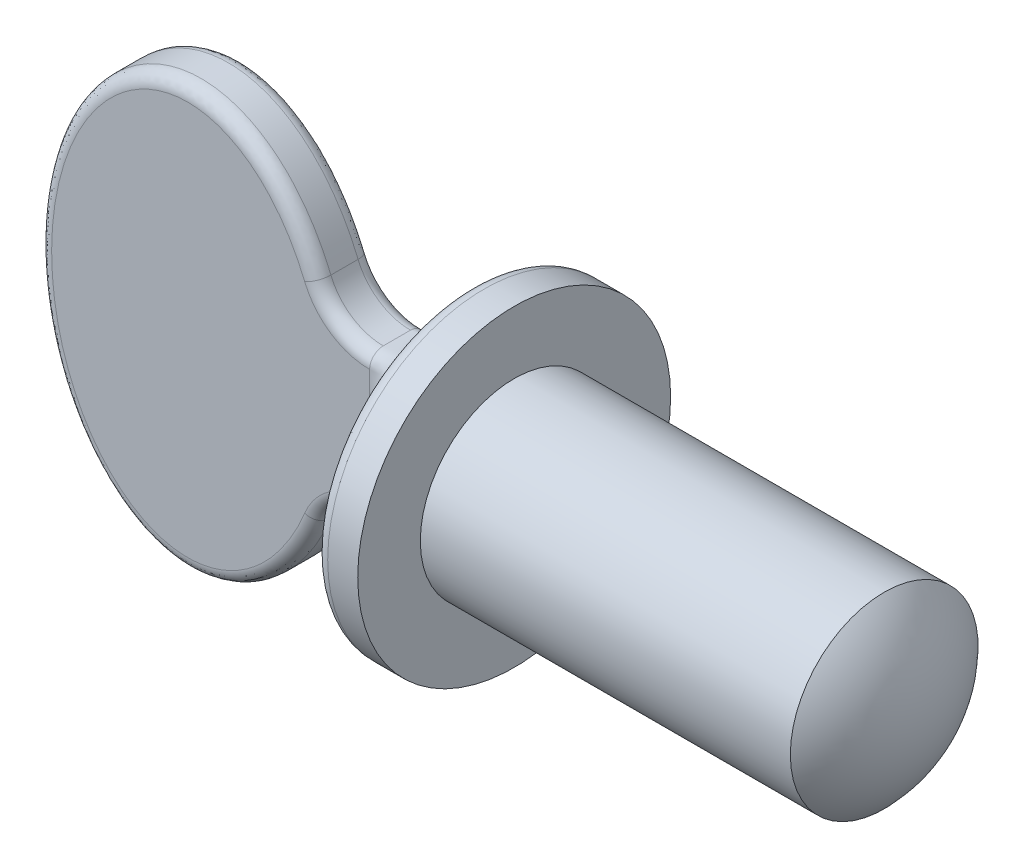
ISO-10303-21;
HEADER;
FILE_DESCRIPTION(('STEP AP214'),'2;1');
FILE_NAME('part.step','',(''),(''),'','','');
FILE_SCHEMA(('AUTOMOTIVE_DESIGN { 1 0 10303 214 1 1 1 1 }'));
ENDSEC;
DATA;
#1=APPLICATION_CONTEXT('core data for automotive mechanical design processes');
#2=APPLICATION_PROTOCOL_DEFINITION('international standard','automotive_design',2000,#1);
#3=PRODUCT_CONTEXT('',#1,'mechanical');
#4=PRODUCT('Part','Part','',(#3));
#5=PRODUCT_RELATED_PRODUCT_CATEGORY('part','',(#4));
#6=PRODUCT_DEFINITION_FORMATION('','',#4);
#7=PRODUCT_DEFINITION_CONTEXT('part definition',#1,'design');
#8=PRODUCT_DEFINITION('design','',#6,#7);
#9=PRODUCT_DEFINITION_SHAPE('','',#8);
#10=(LENGTH_UNIT() NAMED_UNIT(*) SI_UNIT(.MILLI.,.METRE.));
#11=(NAMED_UNIT(*) PLANE_ANGLE_UNIT() SI_UNIT($,.RADIAN.));
#12=(NAMED_UNIT(*) SI_UNIT($,.STERADIAN.) SOLID_ANGLE_UNIT());
#13=UNCERTAINTY_MEASURE_WITH_UNIT(LENGTH_MEASURE(1.E-05),#10,'distance_accuracy_value','');
#14=(GEOMETRIC_REPRESENTATION_CONTEXT(3) GLOBAL_UNCERTAINTY_ASSIGNED_CONTEXT((#13)) GLOBAL_UNIT_ASSIGNED_CONTEXT((#10,
#11,#12)) REPRESENTATION_CONTEXT('',''));
#15=CARTESIAN_POINT('',(0.,0.,0.));
#16=DIRECTION('',(0.,0.,1.));
#17=DIRECTION('',(1.,0.,0.));
#18=AXIS2_PLACEMENT_3D('',#15,#16,#17);
#19=CARTESIAN_POINT('',(3.39763741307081,-2.36920294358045,0.508));
#20=DIRECTION('',(0.,0.,-1.));
#21=DIRECTION('',(-1.,0.,0.));
#22=AXIS2_PLACEMENT_3D('',#19,#20,#21);
#23=CYLINDRICAL_SURFACE('',#22,1.05686961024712);
#24=DIRECTION('',(0.,0.,-1.));
#25=VECTOR('',#24,1.);
#26=CARTESIAN_POINT('',(2.41967497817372,-1.9685,0.508));
#27=LINE('',#26,#25);
#28=CARTESIAN_POINT('',(2.41967497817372,-1.9685,0.254));
#29=VERTEX_POINT('',#28);
#30=CARTESIAN_POINT('',(2.41967497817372,-1.9685,-0.254));
#31=VERTEX_POINT('',#30);
#32=EDGE_CURVE('E427',#29,#31,#27,.T.);
#33=ORIENTED_EDGE('',*,*,#32,.T.);
#34=CARTESIAN_POINT('',(3.39763741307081,-2.36920294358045,-0.254));
#35=DIRECTION('',(0.,0.,1.));
#36=DIRECTION('',(1.,0.,0.));
#37=AXIS2_PLACEMENT_3D('',#34,#35,#36);
#38=CIRCLE('',#37,1.05686961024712);
#39=CARTESIAN_POINT('',(3.39763741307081,-1.31233333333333,-0.254));
#40=VERTEX_POINT('',#39);
#41=EDGE_CURVE('E704',#31,#40,#38,.F.);
#42=ORIENTED_EDGE('',*,*,#41,.T.);
#43=DIRECTION('',(0.,0.,-1.));
#44=VECTOR('',#43,1.);
#45=CARTESIAN_POINT('',(3.39763741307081,-1.31233333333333,0.508));
#46=LINE('',#45,#44);
#47=CARTESIAN_POINT('',(3.39763741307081,-1.31233333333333,0.254));
#48=VERTEX_POINT('',#47);
#49=EDGE_CURVE('E360',#48,#40,#46,.T.);
#50=ORIENTED_EDGE('',*,*,#49,.F.);
#51=CARTESIAN_POINT('',(3.39763741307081,-2.36920294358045,0.254));
#52=DIRECTION('',(0.,0.,1.));
#53=DIRECTION('',(1.,0.,0.));
#54=AXIS2_PLACEMENT_3D('',#51,#52,#53);
#55=CIRCLE('',#54,1.05686961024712);
#56=EDGE_CURVE('E703',#48,#29,#55,.T.);
#57=ORIENTED_EDGE('',*,*,#56,.T.);
#58=EDGE_LOOP('',(#33,#42,#50,#57));
#59=FACE_BOUND('',#58,.T.);
#60=ADVANCED_FACE('F265',(#59),#23,.F.);
#61=CARTESIAN_POINT('',(3.39763741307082,2.36920294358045,0.508));
#62=DIRECTION('',(0.,0.,-1.));
#63=DIRECTION('',(-1.,0.,0.));
#64=AXIS2_PLACEMENT_3D('',#61,#62,#63);
#65=CYLINDRICAL_SURFACE('',#64,1.05686961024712);
#66=DIRECTION('',(0.,0.,-1.));
#67=VECTOR('',#66,1.);
#68=CARTESIAN_POINT('',(3.39763741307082,1.31233333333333,0.508));
#69=LINE('',#68,#67);
#70=CARTESIAN_POINT('',(3.39763741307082,1.31233333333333,0.254));
#71=VERTEX_POINT('',#70);
#72=CARTESIAN_POINT('',(3.39763741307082,1.31233333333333,-0.254));
#73=VERTEX_POINT('',#72);
#74=EDGE_CURVE('E613',#71,#73,#69,.T.);
#75=ORIENTED_EDGE('',*,*,#74,.T.);
#76=CARTESIAN_POINT('',(3.39763741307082,2.36920294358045,-0.254));
#77=DIRECTION('',(0.,0.,1.));
#78=DIRECTION('',(1.,0.,0.));
#79=AXIS2_PLACEMENT_3D('',#76,#77,#78);
#80=CIRCLE('',#79,1.05686961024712);
#81=CARTESIAN_POINT('',(2.41967497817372,1.9685,-0.254));
#82=VERTEX_POINT('',#81);
#83=EDGE_CURVE('E545',#73,#82,#80,.F.);
#84=ORIENTED_EDGE('',*,*,#83,.T.);
#85=DIRECTION('',(0.,0.,-1.));
#86=VECTOR('',#85,1.);
#87=CARTESIAN_POINT('',(2.41967497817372,1.9685,0.508));
#88=LINE('',#87,#86);
#89=CARTESIAN_POINT('',(2.41967497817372,1.9685,0.254));
#90=VERTEX_POINT('',#89);
#91=EDGE_CURVE('E611',#90,#82,#88,.T.);
#92=ORIENTED_EDGE('',*,*,#91,.F.);
#93=CARTESIAN_POINT('',(3.39763741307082,2.36920294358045,0.254));
#94=DIRECTION('',(0.,0.,1.));
#95=DIRECTION('',(1.,0.,0.));
#96=AXIS2_PLACEMENT_3D('',#93,#94,#95);
#97=CIRCLE('',#96,1.05686961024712);
#98=EDGE_CURVE('E538',#90,#71,#97,.T.);
#99=ORIENTED_EDGE('',*,*,#98,.T.);
#100=EDGE_LOOP('',(#75,#84,#92,#99));
#101=FACE_BOUND('',#100,.T.);
#102=ADVANCED_FACE('F434',(#101),#65,.F.);
#103=CARTESIAN_POINT('',(0.,0.,0.508));
#104=DIRECTION('',(0.,0.,1.));
#105=DIRECTION('',(0.,1.,0.));
#106=AXIS2_PLACEMENT_3D('',#103,#104,#105);
#107=ELLIPSE('',#106,3.937,2.794);
#108=DIRECTION('',(0.,0.,-1.));
#109=VECTOR('',#108,1.);
#110=SURFACE_OF_LINEAR_EXTRUSION('',#107,#109);
#111=ORIENTED_EDGE('',*,*,#91,.T.);
#112=CARTESIAN_POINT('',(-2.42953871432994,-1.06988650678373,-0.508));
#113=CARTESIAN_POINT('',(-2.67806308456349,-1.1223425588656,-0.508));
#114=CARTESIAN_POINT('',(-2.67806308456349,-1.1223425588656,-0.254));
#115=CARTESIAN_POINT('',(-2.38132756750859,-1.29830917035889,-0.508));
#116=CARTESIAN_POINT('',(-2.62738331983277,-1.36245895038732,-0.508));
#117=CARTESIAN_POINT('',(-2.62738331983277,-1.36245895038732,-0.254));
#118=CARTESIAN_POINT('',(-2.31706517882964,-1.52335296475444,-0.508));
#119=CARTESIAN_POINT('',(-2.55974244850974,-1.59951584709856,-0.508));
#120=CARTESIAN_POINT('',(-2.55974244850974,-1.59951584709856,-0.254));
#121=CARTESIAN_POINT('',(-2.15402597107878,-1.9606753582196,-0.508));
#122=CARTESIAN_POINT('',(-2.38735395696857,-2.06194694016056,-0.508));
#123=CARTESIAN_POINT('',(-2.38735395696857,-2.06194694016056,-0.254));
#124=CARTESIAN_POINT('',(-2.05530031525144,-2.17297233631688,-0.508));
#125=CARTESIAN_POINT('',(-2.28266133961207,-2.28733788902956,-0.508));
#126=CARTESIAN_POINT('',(-2.28266133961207,-2.28733788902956,-0.254));
#127=CARTESIAN_POINT('',(-1.8565056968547,-2.51319514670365,-0.508));
#128=CARTESIAN_POINT('',(-2.0702557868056,-2.65084271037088,-0.508));
#129=CARTESIAN_POINT('',(-2.0702557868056,-2.65084271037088,-0.254));
#130=CARTESIAN_POINT('',(-1.76631603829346,-2.64689289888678,-0.508));
#131=CARTESIAN_POINT('',(-1.97351333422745,-2.79437306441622,-0.508));
#132=CARTESIAN_POINT('',(-1.97351333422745,-2.79437306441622,-0.254));
#133=CARTESIAN_POINT('',(-1.56670354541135,-2.89917346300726,-0.508));
#134=CARTESIAN_POINT('',(-1.75790917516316,-3.06687436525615,-0.508));
#135=CARTESIAN_POINT('',(-1.75790917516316,-3.06687436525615,-0.254));
#136=CARTESIAN_POINT('',(-1.45730856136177,-3.01777773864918,-0.508));
#137=CARTESIAN_POINT('',(-1.63907948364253,-3.19586595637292,-0.508));
#138=CARTESIAN_POINT('',(-1.63907948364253,-3.19586595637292,-0.254));
#139=CARTESIAN_POINT('',(-1.24726681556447,-3.20759724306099,-0.508));
#140=CARTESIAN_POINT('',(-1.40883959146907,-3.40393298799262,-0.508));
#141=CARTESIAN_POINT('',(-1.40883959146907,-3.40393298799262,-0.254));
#142=CARTESIAN_POINT('',(-1.1507555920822,-3.28336841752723,-0.508));
#143=CARTESIAN_POINT('',(-1.30241841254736,-3.487576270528,-0.508));
#144=CARTESIAN_POINT('',(-1.30241841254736,-3.487576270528,-0.254));
#145=CARTESIAN_POINT('',(-0.946803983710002,-3.41849479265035,-0.508));
#146=CARTESIAN_POINT('',(-1.07576597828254,-3.63774144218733,-0.508));
#147=CARTESIAN_POINT('',(-1.07576597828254,-3.63774144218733,-0.254));
#148=CARTESIAN_POINT('',(-0.839378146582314,-3.47787146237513,-0.508));
#149=CARTESIAN_POINT('',(-0.955553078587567,-3.70428571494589,-0.508));
#150=CARTESIAN_POINT('',(-0.955553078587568,-3.70428571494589,-0.254));
#151=CARTESIAN_POINT('',(-0.633843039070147,-3.56789218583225,-0.508));
#152=CARTESIAN_POINT('',(-0.723818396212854,-3.80577636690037,-0.508));
#153=CARTESIAN_POINT('',(-0.723818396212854,-3.80577636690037,-0.254));
#154=CARTESIAN_POINT('',(-0.537108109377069,-3.60165598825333,-0.508));
#155=CARTESIAN_POINT('',(-0.614119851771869,-3.84411987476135,-0.508));
#156=CARTESIAN_POINT('',(-0.614119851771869,-3.84411987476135,-0.254));
#157=CARTESIAN_POINT('',(-0.339331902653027,-3.65248383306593,-0.508));
#158=CARTESIAN_POINT('',(-0.388801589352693,-3.90202243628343,-0.508));
#159=CARTESIAN_POINT('',(-0.388801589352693,-3.90202243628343,-0.254));
#160=CARTESIAN_POINT('',(-0.238293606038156,-3.66955924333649,-0.508));
#161=CARTESIAN_POINT('',(-0.273185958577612,-3.92159427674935,-0.508));
#162=CARTESIAN_POINT('',(-0.273185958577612,-3.92159427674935,-0.254));
#163=CARTESIAN_POINT('',(-0.0344753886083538,-3.68567445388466,-0.508));
#164=CARTESIAN_POINT('',(-0.0395873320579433,-3.94006182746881,-0.508));
#165=CARTESIAN_POINT('',(-0.0395873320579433,-3.94006182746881,-0.254));
#166=CARTESIAN_POINT('',(0.0683086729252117,-3.68466274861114,-0.508));
#167=CARTESIAN_POINT('',(0.0784014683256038,-3.93889849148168,-0.508));
#168=CARTESIAN_POINT('',(0.0784014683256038,-3.93889849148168,-0.254));
#169=CARTESIAN_POINT('',(0.272088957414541,-3.66456417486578,-0.508));
#170=CARTESIAN_POINT('',(0.311869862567,-3.91587428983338,-0.508));
#171=CARTESIAN_POINT('',(0.311869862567,-3.91587428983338,-0.254));
#172=CARTESIAN_POINT('',(0.373084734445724,-3.64547286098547,-0.508));
#173=CARTESIAN_POINT('',(0.427348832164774,-3.89400833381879,-0.508));
#174=CARTESIAN_POINT('',(0.427348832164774,-3.89400833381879,-0.254));
#175=CARTESIAN_POINT('',(0.566584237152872,-3.5918099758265,-0.508));
#176=CARTESIAN_POINT('',(0.647572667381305,-3.83293861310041,-0.508));
#177=CARTESIAN_POINT('',(0.647572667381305,-3.83293861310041,-0.254));
#178=CARTESIAN_POINT('',(0.659265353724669,-3.5578663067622,-0.508));
#179=CARTESIAN_POINT('',(0.75256001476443,-3.79443882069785,-0.508));
#180=CARTESIAN_POINT('',(0.75256001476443,-3.79443882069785,-0.254));
#181=CARTESIAN_POINT('',(0.838615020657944,-3.47679355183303,-0.508));
#182=CARTESIAN_POINT('',(0.954592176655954,-3.70311336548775,-0.508));
#183=CARTESIAN_POINT('',(0.954592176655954,-3.70311336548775,-0.254));
#184=CARTESIAN_POINT('',(0.925281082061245,-3.42965904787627,-0.508));
#185=CARTESIAN_POINT('',(1.05163370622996,-3.65028181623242,-0.508));
#186=CARTESIAN_POINT('',(1.05163370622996,-3.65028181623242,-0.254));
#187=CARTESIAN_POINT('',(1.12953179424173,-3.30045366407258,-0.508));
#188=CARTESIAN_POINT('',(1.27904250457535,-3.50643406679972,-0.508));
#189=CARTESIAN_POINT('',(1.27904250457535,-3.50643406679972,-0.254));
#190=CARTESIAN_POINT('',(1.24323792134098,-3.21224549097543,-0.508));
#191=CARTESIAN_POINT('',(1.40447787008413,-3.40898221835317,-0.508));
#192=CARTESIAN_POINT('',(1.40447787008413,-3.40898221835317,-0.254));
#193=CARTESIAN_POINT('',(1.45504675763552,-3.01870052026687,-0.508));
#194=CARTESIAN_POINT('',(1.63653892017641,-3.19692872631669,-0.508));
#195=CARTESIAN_POINT('',(1.63653892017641,-3.19692872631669,-0.254));
#196=CARTESIAN_POINT('',(1.55311138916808,-2.91332314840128,-0.508));
#197=CARTESIAN_POINT('',(1.74311876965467,-3.08228651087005,-0.508));
#198=CARTESIAN_POINT('',(1.74311876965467,-3.08228651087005,-0.254));
#199=CARTESIAN_POINT('',(1.75678198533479,-2.66196868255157,-0.508));
#200=CARTESIAN_POINT('',(1.9633248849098,-2.81052824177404,-0.508));
#201=CARTESIAN_POINT('',(1.9633248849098,-2.81052824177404,-0.254));
#202=CARTESIAN_POINT('',(1.85800944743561,-2.51246781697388,-0.508));
#203=CARTESIAN_POINT('',(2.07190130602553,-2.65000792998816,-0.508));
#204=CARTESIAN_POINT('',(2.07190130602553,-2.65000792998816,-0.254));
#205=CARTESIAN_POINT('',(2.03785333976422,-2.20076254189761,-0.508));
#206=CARTESIAN_POINT('',(2.26397611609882,-2.31709468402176,-0.508));
#207=CARTESIAN_POINT('',(2.26397611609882,-2.31709468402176,-0.254));
#208=CARTESIAN_POINT('',(2.11647846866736,-2.03856305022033,-0.508));
#209=CARTESIAN_POINT('',(2.34748415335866,-2.14470634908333,-0.508));
#210=CARTESIAN_POINT('',(2.34748415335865,-2.14470634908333,-0.254));
#211=CARTESIAN_POINT('',(2.22461915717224,-1.7746150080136,-0.508));
#212=CARTESIAN_POINT('',(2.46201925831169,-1.8651443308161,-0.508));
#213=CARTESIAN_POINT('',(2.46201925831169,-1.8651443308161,-0.254));
#214=CARTESIAN_POINT('',(2.2609989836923,-1.67559877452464,-0.508));
#215=CARTESIAN_POINT('',(2.5004698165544,-1.76047506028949,-0.508));
#216=CARTESIAN_POINT('',(2.5004698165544,-1.76047506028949,-0.254));
#217=CARTESIAN_POINT('',(2.32683156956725,-1.47533598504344,-0.508));
#218=CARTESIAN_POINT('',(2.56995291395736,-1.54910644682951,-0.508));
#219=CARTESIAN_POINT('',(2.56995291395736,-1.54910644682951,-0.254));
#220=CARTESIAN_POINT('',(2.35628633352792,-1.37409008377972,-0.508));
#221=CARTESIAN_POINT('',(2.60098759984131,-1.44240770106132,-0.508));
#222=CARTESIAN_POINT('',(2.60098759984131,-1.44240770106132,-0.254));
#223=CARTESIAN_POINT('',(2.45282237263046,-0.99672785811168,-0.508));
#224=CARTESIAN_POINT('',(2.70261039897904,-1.04518135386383,-0.508));
#225=CARTESIAN_POINT('',(2.70261039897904,-1.04518135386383,-0.254));
#226=CARTESIAN_POINT('',(2.49907252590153,-0.715044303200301,-0.508));
#227=CARTESIAN_POINT('',(2.7510952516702,-0.74956565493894,-0.508));
#228=CARTESIAN_POINT('',(2.7510952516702,-0.74956565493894,-0.254));
#229=CARTESIAN_POINT('',(2.54567248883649,-0.147495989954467,-0.508));
#230=CARTESIAN_POINT('',(2.79994937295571,-0.154504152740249,-0.508));
#231=CARTESIAN_POINT('',(2.79994937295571,-0.154504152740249,-0.254));
#232=CARTESIAN_POINT('',(2.54590842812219,0.138377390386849,-0.508));
#233=CARTESIAN_POINT('',(2.80019927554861,0.144949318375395,-0.508));
#234=CARTESIAN_POINT('',(2.80019927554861,0.144949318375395,-0.254));
#235=CARTESIAN_POINT('',(2.50314262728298,0.670744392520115,-0.508));
#236=CARTESIAN_POINT('',(2.75536014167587,0.703113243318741,-0.508));
#237=CARTESIAN_POINT('',(2.75536014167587,0.703113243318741,-0.254));
#238=CARTESIAN_POINT('',(2.46556625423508,0.917675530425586,-0.508));
#239=CARTESIAN_POINT('',(2.71596009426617,0.962218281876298,-0.508));
#240=CARTESIAN_POINT('',(2.71596009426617,0.962218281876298,-0.254));
#241=CARTESIAN_POINT('',(2.35351407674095,1.40317160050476,-0.508));
#242=CARTESIAN_POINT('',(2.5981091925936,1.47286514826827,-0.508));
#243=CARTESIAN_POINT('',(2.5981091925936,1.47286514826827,-0.254));
#244=CARTESIAN_POINT('',(2.27905720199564,1.64174075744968,-0.508));
#245=CARTESIAN_POINT('',(2.51967837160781,1.72441078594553,-0.508));
#246=CARTESIAN_POINT('',(2.51967837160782,1.72441078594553,-0.254));
#247=CARTESIAN_POINT('',(2.10296943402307,2.07153806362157,-0.508));
#248=CARTESIAN_POINT('',(2.33317448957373,2.17963119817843,-0.508));
#249=CARTESIAN_POINT('',(2.33317448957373,2.17963119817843,-0.254));
#250=CARTESIAN_POINT('',(2.00636516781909,2.26480890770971,-0.508));
#251=CARTESIAN_POINT('',(2.23053377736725,2.38518362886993,-0.508));
#252=CARTESIAN_POINT('',(2.23053377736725,2.38518362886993,-0.254));
#253=CARTESIAN_POINT('',(1.78047465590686,2.63124667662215,-0.508));
#254=CARTESIAN_POINT('',(1.98878457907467,2.77737954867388,-0.508));
#255=CARTESIAN_POINT('',(1.98878457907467,2.77737954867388,-0.254));
#256=CARTESIAN_POINT('',(1.65129083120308,2.80447416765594,-0.508));
#257=CARTESIAN_POINT('',(1.84979032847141,2.96407977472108,-0.508));
#258=CARTESIAN_POINT('',(1.84979032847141,2.96407977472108,-0.254));
#259=CARTESIAN_POINT('',(1.41779860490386,3.05444647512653,-0.508));
#260=CARTESIAN_POINT('',(1.59578914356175,3.23598875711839,-0.508));
#261=CARTESIAN_POINT('',(1.59578914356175,3.23598875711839,-0.254));
#262=CARTESIAN_POINT('',(1.32477852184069,3.14175732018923,-0.508));
#263=CARTESIAN_POINT('',(1.49405856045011,3.33156937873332,-0.508));
#264=CARTESIAN_POINT('',(1.49405856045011,3.33156937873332,-0.254));
#265=CARTESIAN_POINT('',(1.1264653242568,3.3011914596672,-0.508));
#266=CARTESIAN_POINT('',(1.27551873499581,3.50726804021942,-0.508));
#267=CARTESIAN_POINT('',(1.27551873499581,3.50726804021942,-0.254));
#268=CARTESIAN_POINT('',(1.02118853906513,3.37333460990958,-0.508));
#269=CARTESIAN_POINT('',(1.15872953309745,3.58740628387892,-0.508));
#270=CARTESIAN_POINT('',(1.15872953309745,3.58740628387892,-0.254));
#271=CARTESIAN_POINT('',(0.817330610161,3.48785914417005,-0.508));
#272=CARTESIAN_POINT('',(0.930720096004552,3.7154934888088,-0.508));
#273=CARTESIAN_POINT('',(0.930720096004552,3.7154934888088,-0.254));
#274=CARTESIAN_POINT('',(0.720402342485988,3.53316262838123,-0.508));
#275=CARTESIAN_POINT('',(0.821632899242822,3.76654812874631,-0.508));
#276=CARTESIAN_POINT('',(0.821632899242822,3.76654812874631,-0.254));
#277=CARTESIAN_POINT('',(0.520328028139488,3.60703504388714,-0.508));
#278=CARTESIAN_POINT('',(0.595089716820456,3.85018992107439,-0.508));
#279=CARTESIAN_POINT('',(0.595089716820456,3.85018992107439,-0.254));
#280=CARTESIAN_POINT('',(0.417186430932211,3.63561579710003,-0.508));
#281=CARTESIAN_POINT('',(0.477639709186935,3.88279011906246,-0.508));
#282=CARTESIAN_POINT('',(0.477639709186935,3.88279011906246,-0.254));
#283=CARTESIAN_POINT('',(0.206818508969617,3.67387815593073,-0.508));
#284=CARTESIAN_POINT('',(0.237206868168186,3.92651558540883,-0.508));
#285=CARTESIAN_POINT('',(0.237206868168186,3.92651558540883,-0.254));
#286=CARTESIAN_POINT('',(0.0995732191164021,3.68345742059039,-0.508));
#287=CARTESIAN_POINT('',(0.114197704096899,3.9375245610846,-0.508));
#288=CARTESIAN_POINT('',(0.114197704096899,3.9375245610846,-0.254));
#289=CARTESIAN_POINT('',(-0.114821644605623,3.68250895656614,-0.508));
#290=CARTESIAN_POINT('',(-0.131686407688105,3.93643687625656,-0.508));
#291=CARTESIAN_POINT('',(-0.131686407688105,3.93643687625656,-0.254));
#292=CARTESIAN_POINT('',(-0.221971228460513,3.67198365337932,-0.508));
#293=CARTESIAN_POINT('',(-0.254561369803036,3.92434300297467,-0.508));
#294=CARTESIAN_POINT('',(-0.254561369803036,3.92434300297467,-0.254));
#295=CARTESIAN_POINT('',(-0.423404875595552,3.6335702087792,-0.508));
#296=CARTESIAN_POINT('',(-0.484708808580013,3.88045959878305,-0.508));
#297=CARTESIAN_POINT('',(-0.484708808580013,3.88045959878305,-0.254));
#298=CARTESIAN_POINT('',(-0.517999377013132,3.60726509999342,-0.508));
#299=CARTESIAN_POINT('',(-0.592410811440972,3.85046695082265,-0.508));
#300=CARTESIAN_POINT('',(-0.592410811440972,3.85046695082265,-0.254));
#301=CARTESIAN_POINT('',(-0.702018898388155,3.54051420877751,-0.508));
#302=CARTESIAN_POINT('',(-0.80085538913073,3.77485728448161,-0.508));
#303=CARTESIAN_POINT('',(-0.800855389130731,3.77485728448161,-0.254));
#304=CARTESIAN_POINT('',(-0.791441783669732,3.5000626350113,-0.508));
#305=CARTESIAN_POINT('',(-0.901595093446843,3.72923386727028,-0.508));
#306=CARTESIAN_POINT('',(-0.901595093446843,3.72923386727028,-0.254));
#307=CARTESIAN_POINT('',(-0.995772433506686,3.38993421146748,-0.508));
#308=CARTESIAN_POINT('',(-1.13047031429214,3.60588286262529,-0.508));
#309=CARTESIAN_POINT('',(-1.13047031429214,3.60588286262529,-0.254));
#310=CARTESIAN_POINT('',(-1.10783636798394,3.31498239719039,-0.508));
#311=CARTESIAN_POINT('',(-1.25491481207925,3.52252387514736,-0.508));
#312=CARTESIAN_POINT('',(-1.25491481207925,3.52252387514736,-0.254));
#313=CARTESIAN_POINT('',(-1.31837395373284,3.14796333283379,-0.508));
#314=CARTESIAN_POINT('',(-1.48706802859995,3.33835616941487,-0.508));
#315=CARTESIAN_POINT('',(-1.48706802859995,3.33835616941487,-0.254));
#316=CARTESIAN_POINT('',(-1.41681992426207,3.05586208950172,-0.508));
#317=CARTESIAN_POINT('',(-1.59474271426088,3.23751282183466,-0.508));
#318=CARTESIAN_POINT('',(-1.59474271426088,3.23751282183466,-0.254));
#319=CARTESIAN_POINT('',(-1.63609804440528,2.82020806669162,-0.508));
#320=CARTESIAN_POINT('',(-1.83323646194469,2.98121697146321,-0.508));
#321=CARTESIAN_POINT('',(-1.83323646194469,2.98121697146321,-0.254));
#322=CARTESIAN_POINT('',(-1.75048386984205,2.67067473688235,-0.508));
#323=CARTESIAN_POINT('',(-1.95647717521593,2.81989583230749,-0.508));
#324=CARTESIAN_POINT('',(-1.95647717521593,2.81989583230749,-0.254));
#325=CARTESIAN_POINT('',(-1.95420988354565,2.35553788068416,-0.508));
#326=CARTESIAN_POINT('',(-2.1748556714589,2.48207587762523,-0.508));
#327=CARTESIAN_POINT('',(-2.1748556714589,2.48207587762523,-0.254));
#328=CARTESIAN_POINT('',(-2.04350621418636,2.18990688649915,-0.508));
#329=CARTESIAN_POINT('',(-2.2699442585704,2.30555118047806,-0.508));
#330=CARTESIAN_POINT('',(-2.2699442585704,2.30555118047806,-0.254));
#331=CARTESIAN_POINT('',(-2.22882804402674,1.78241164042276,-0.508));
#332=CARTESIAN_POINT('',(-2.46665332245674,1.87302961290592,-0.508));
#333=CARTESIAN_POINT('',(-2.46665332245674,1.87302961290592,-0.254));
#334=CARTESIAN_POINT('',(-2.3142397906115,1.53572223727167,-0.508));
#335=CARTESIAN_POINT('',(-2.55672789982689,1.61257271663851,-0.508));
#336=CARTESIAN_POINT('',(-2.55672789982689,1.61257271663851,-0.254));
#337=CARTESIAN_POINT('',(-2.44446639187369,1.03199799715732,-0.508));
#338=CARTESIAN_POINT('',(-2.69381177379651,1.08228449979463,-0.508));
#339=CARTESIAN_POINT('',(-2.69381177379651,1.08228449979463,-0.254));
#340=CARTESIAN_POINT('',(-2.48924065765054,0.774953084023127,-0.508));
#341=CARTESIAN_POINT('',(-2.74077801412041,0.812444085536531,-0.508));
#342=CARTESIAN_POINT('',(-2.74077801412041,0.812444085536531,-0.254));
#343=CARTESIAN_POINT('',(-2.54075598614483,0.251563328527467,-0.508));
#344=CARTESIAN_POINT('',(-2.79480168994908,0.263568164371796,-0.508));
#345=CARTESIAN_POINT('',(-2.79480168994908,0.263568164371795,-0.254));
#346=CARTESIAN_POINT('',(-2.54666205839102,-0.0148627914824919,-0.508));
#347=CARTESIAN_POINT('',(-2.80098296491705,-0.015540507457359,-0.508));
#348=CARTESIAN_POINT('',(-2.80098296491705,-0.0155405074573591,-0.254));
#349=CARTESIAN_POINT('',(-2.51848120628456,-0.545613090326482,-0.508));
#350=CARTESIAN_POINT('',(-2.77144588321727,-0.571867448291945,-0.508));
#351=CARTESIAN_POINT('',(-2.77144588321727,-0.571867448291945,-0.254));
#352=CARTESIAN_POINT('',(-2.48440379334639,-0.809937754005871,-0.508));
#353=CARTESIAN_POINT('',(-2.73573749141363,-0.849086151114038,-0.508));
#354=CARTESIAN_POINT('',(-2.73573749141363,-0.849086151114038,-0.254));
#355=CARTESIAN_POINT('',(-2.42953871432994,-1.06988650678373,-0.508));
#356=CARTESIAN_POINT('',(-2.67806308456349,-1.1223425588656,-0.508));
#357=CARTESIAN_POINT('',(-2.67806308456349,-1.1223425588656,-0.254));
#358=(BOUNDED_SURFACE() B_SPLINE_SURFACE(3,2,((#112,#113,#114),(#115,#116,#117),(#118,#119,
#120),(#121,#122,#123),(#124,#125,#126),(#127,#128,#129),(#130,#131,#132),(#133,#134,#135),
(#136,#137,#138),(#139,#140,#141),(#142,#143,#144),(#145,#146,#147),(#148,#149,#150),(#151,#152,
#153),(#154,#155,#156),(#157,#158,#159),(#160,#161,#162),(#163,#164,#165),(#166,#167,#168),
(#169,#170,#171),(#172,#173,#174),(#175,#176,#177),(#178,#179,#180),(#181,#182,#183),(#184,#185,
#186),(#187,#188,#189),(#190,#191,#192),(#193,#194,#195),(#196,#197,#198),(#199,#200,#201),
(#202,#203,#204),(#205,#206,#207),(#208,#209,#210),(#211,#212,#213),(#214,#215,#216),(#217,#218,
#219),(#220,#221,#222),(#223,#224,#225),(#226,#227,#228),(#229,#230,#231),(#232,#233,#234),
(#235,#236,#237),(#238,#239,#240),(#241,#242,#243),(#244,#245,#246),(#247,#248,#249),(#250,#251,
#252),(#253,#254,#255),(#256,#257,#258),(#259,#260,#261),(#262,#263,#264),(#265,#266,#267),
(#268,#269,#270),(#271,#272,#273),(#274,#275,#276),(#277,#278,#279),(#280,#281,#282),(#283,#284,
#285),(#286,#287,#288),(#289,#290,#291),(#292,#293,#294),(#295,#296,#297),(#298,#299,#300),
(#301,#302,#303),(#304,#305,#306),(#307,#308,#309),(#310,#311,#312),(#313,#314,#315),(#316,#317,
#318),(#319,#320,#321),(#322,#323,#324),(#325,#326,#327),(#328,#329,#330),(#331,#332,#333),
(#334,#335,#336),(#337,#338,#339),(#340,#341,#342),(#343,#344,#345),(#346,#347,#348),(#349,#350,
#351),(#352,#353,#354),(#355,#356,#357)),.UNSPECIFIED.,.T.,.F.,
.F.) B_SPLINE_SURFACE_WITH_KNOTS((4,2,2,2,2,2,2,2,2,2,2,2,2,2,2,2,2,2,2,2,2,2,2,2,2,2,2,2,2,2,2,
2,2,2,2,2,2,2,2,2,4),(3,3),(0.,0.699735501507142,1.39843658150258,1.88081590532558,
2.36250140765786,2.7293120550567,3.09564005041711,3.401707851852,3.7075670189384,
4.01429730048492,4.32110302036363,4.61603131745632,4.91108093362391,5.34040544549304,
5.77075965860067,6.31008999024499,6.84921247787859,7.16544039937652,7.48157666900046,
8.33348152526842,9.18749454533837,9.93427445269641,10.6806714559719,11.3262865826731,
11.9698968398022,12.3514499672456,12.7325004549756,13.052173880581,13.371621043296,
13.6927841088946,14.0139084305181,14.3072154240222,14.6006426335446,15.0028628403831,
15.405888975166,15.9675913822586,16.530269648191,17.3092934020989,18.0890943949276,
18.8855943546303,19.6819048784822),(0.,1.),
.UNSPECIFIED.) GEOMETRIC_REPRESENTATION_ITEM() RATIONAL_B_SPLINE_SURFACE(((1.,0.707106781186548,
1.),(1.,0.707106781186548,1.),(1.,0.707106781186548,1.),(1.,0.707106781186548,1.),(1.,
0.707106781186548,1.),(1.,0.707106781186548,1.),(1.,0.707106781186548,1.),(1.,0.707106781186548,
1.),(1.,0.707106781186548,1.),(1.,0.707106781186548,1.),(1.,0.707106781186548,1.),(1.,
0.707106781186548,1.),(1.,0.707106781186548,1.),(1.,0.707106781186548,1.),(1.,0.707106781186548,
1.),(1.,0.707106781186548,1.),(1.,0.707106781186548,1.),(1.,0.707106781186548,1.),(1.,
0.707106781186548,1.),(1.,0.707106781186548,1.),(1.,0.707106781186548,1.),(1.,0.707106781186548,
1.),(1.,0.707106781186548,1.),(1.,0.707106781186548,1.),(1.,0.707106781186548,1.),(1.,
0.707106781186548,1.),(1.,0.707106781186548,1.),(1.,0.707106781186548,1.),(1.,0.707106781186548,
1.),(1.,0.707106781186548,1.),(1.,0.707106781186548,1.),(1.,0.707106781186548,1.),(1.,
0.707106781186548,1.),(1.,0.707106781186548,1.),(1.,0.707106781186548,1.),(1.,0.707106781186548,
1.),(1.,0.707106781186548,1.),(1.,0.707106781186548,1.),(1.,0.707106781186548,1.),(1.,
0.707106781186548,1.),(1.,0.707106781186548,1.),(1.,0.707106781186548,1.),(1.,0.707106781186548,
1.),(1.,0.707106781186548,1.),(1.,0.707106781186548,1.),(1.,0.707106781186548,1.),(1.,
0.707106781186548,1.),(1.,0.707106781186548,1.),(1.,0.707106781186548,1.),(1.,0.707106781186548,
1.),(1.,0.707106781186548,1.),(1.,0.707106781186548,1.),(1.,0.707106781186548,1.),(1.,
0.707106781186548,1.),(1.,0.707106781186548,1.),(1.,0.707106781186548,1.),(1.,0.707106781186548,
1.),(1.,0.707106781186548,1.),(1.,0.707106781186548,1.),(1.,0.707106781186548,1.),(1.,
0.707106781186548,1.),(1.,0.707106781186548,1.),(1.,0.707106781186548,1.),(1.,0.707106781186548,
1.),(1.,0.707106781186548,1.),(1.,0.707106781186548,1.),(1.,0.707106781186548,1.),(1.,
0.707106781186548,1.),(1.,0.707106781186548,1.),(1.,0.707106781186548,1.),(1.,0.707106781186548,
1.),(1.,0.707106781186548,1.),(1.,0.707106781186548,1.),(1.,0.707106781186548,1.),(1.,
0.707106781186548,1.),(1.,0.707106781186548,1.),(1.,0.707106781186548,1.),(1.,0.707106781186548,
1.),(1.,0.707106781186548,1.),(1.,0.707106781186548,1.),(1.,0.707106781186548,1.),(1.,
0.707106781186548,1.))) REPRESENTATION_ITEM('') SURFACE());
#359=CARTESIAN_POINT('',(2.41967497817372,1.9685,-0.254));
#360=CARTESIAN_POINT('',(2.25031042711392,2.38542945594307,-0.254));
#361=CARTESIAN_POINT('',(2.00596675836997,2.79648158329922,-0.254));
#362=CARTESIAN_POINT('',(1.49799160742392,3.34093166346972,-0.254));
#363=CARTESIAN_POINT('',(1.27918524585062,3.52006526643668,-0.254));
#364=CARTESIAN_POINT('',(0.824519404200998,3.77487228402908,-0.254));
#365=CARTESIAN_POINT('',(0.5953372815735,3.86152000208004,-0.254));
#366=CARTESIAN_POINT('',(0.11627433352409,3.94837182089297,-0.254));
#367=CARTESIAN_POINT('',(-0.133883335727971,3.94714153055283,-0.254));
#368=CARTESIAN_POINT('',(-0.592713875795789,3.86005719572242,-0.254));
#369=CARTESIAN_POINT('',(-0.803064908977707,3.78232434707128,-0.254));
#370=CARTESIAN_POINT('',(-1.25884339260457,3.53671269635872,-0.254));
#371=CARTESIAN_POINT('',(-1.49225794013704,3.34730250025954,-0.254));
#372=CARTESIAN_POINT('',(-1.9688886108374,2.83590773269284,-0.254));
#373=CARTESIAN_POINT('',(-2.18567037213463,2.49073765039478,-0.254));
#374=CARTESIAN_POINT('',(-2.57946081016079,1.62514496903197,-0.254));
#375=CARTESIAN_POINT('',(-2.71380281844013,1.08646076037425,-0.254));
#376=CARTESIAN_POINT('',(-2.82215303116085,-0.0142692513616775,-0.254));
#377=CARTESIAN_POINT('',(-2.79328752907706,-0.576559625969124,-0.254));
#378=CARTESIAN_POINT('',(-2.5760189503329,-1.60569439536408,-0.254));
#379=CARTESIAN_POINT('',(-2.40624277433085,-2.07609930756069,-0.254));
#380=CARTESIAN_POINT('',(-1.98146625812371,-2.80261486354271,-0.254));
#381=CARTESIAN_POINT('',(-1.76650882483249,-3.08096180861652,-0.254));
#382=CARTESIAN_POINT('',(-1.30657381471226,-3.49615219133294,-0.254));
#383=CARTESIAN_POINT('',(-1.07838575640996,-3.65062001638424,-0.254));
#384=CARTESIAN_POINT('',(-0.616409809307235,-3.85270583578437,-0.254));
#385=CARTESIAN_POINT('',(-0.388253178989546,-3.91258803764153,-0.254));
#386=CARTESIAN_POINT('',(0.0769150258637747,-3.94918083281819,-0.254));
#387=CARTESIAN_POINT('',(0.313980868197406,-3.92525354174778,-0.254));
#388=CARTESIAN_POINT('',(0.753403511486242,-3.80377336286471,-0.254));
#389=CARTESIAN_POINT('',(0.956930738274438,-3.71016433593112,-0.254));
#390=CARTESIAN_POINT('',(1.40977740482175,-3.42376866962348,-0.254));
#391=CARTESIAN_POINT('',(1.6427552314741,-3.20589476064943,-0.254));
#392=CARTESIAN_POINT('',(2.03111441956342,-2.72710992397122,-0.254));
#393=CARTESIAN_POINT('',(2.18919790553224,-2.46823947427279,-0.254));
#394=CARTESIAN_POINT('',(2.35453247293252,-2.12142025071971,-0.254));
#395=CARTESIAN_POINT('',(2.38815642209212,-2.04532960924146,-0.254));
#396=CARTESIAN_POINT('',(2.41967497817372,-1.9685,-0.254));
#397=B_SPLINE_CURVE_WITH_KNOTS('',3,(#359,#360,#361,#362,#363,#364,#365,#366,#367,#368,#369,
#370,#371,#372,#373,#374,#375,#376,#377,#378,#379,#380,#381,#382,#383,#384,#385,#386,#387,#388,
#389,#390,#391,#392,#393,#394,#395,#396),.UNSPECIFIED.,.F.,.F.,(4,2,2,2,2,2,2,2,2,2,2,2,2,2,2,2,
2,2,4),(0.,1.37556453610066,2.21375379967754,2.93458248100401,3.66717955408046,4.32956836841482,
5.21483606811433,6.41718702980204,8.05393798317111,9.71959706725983,11.1947245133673,
12.2336794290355,13.0458946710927,13.740094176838,14.4395887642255,15.1022444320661,
16.0414723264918,16.9435917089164,17.1929672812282),.UNSPECIFIED.);
#398=EDGE_CURVE('E469',#82,#31,#397,.T.);
#399=ORIENTED_EDGE('',*,*,#398,.T.);
#400=ORIENTED_EDGE('',*,*,#32,.F.);
#401=CARTESIAN_POINT('',(-2.42953871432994,1.06988650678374,0.508));
#402=CARTESIAN_POINT('',(-2.67806308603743,1.12234255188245,0.508));
#403=CARTESIAN_POINT('',(-2.67806308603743,1.12234255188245,0.254));
#404=CARTESIAN_POINT('',(-2.38132756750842,1.29830917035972,0.508));
#405=CARTESIAN_POINT('',(-2.62738332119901,1.36245894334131,0.508));
#406=CARTESIAN_POINT('',(-2.62738332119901,1.36245894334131,0.254));
#407=CARTESIAN_POINT('',(-2.31706517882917,1.52335296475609,0.508));
#408=CARTESIAN_POINT('',(-2.55974244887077,1.59951584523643,0.508));
#409=CARTESIAN_POINT('',(-2.55974244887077,1.59951584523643,0.254));
#410=CARTESIAN_POINT('',(-2.15402597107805,1.96067535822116,0.508));
#411=CARTESIAN_POINT('',(-2.38735395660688,2.06194694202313,0.508));
#412=CARTESIAN_POINT('',(-2.38735395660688,2.06194694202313,0.254));
#413=CARTESIAN_POINT('',(-2.05530031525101,2.17297233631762,0.508));
#414=CARTESIAN_POINT('',(-2.28266133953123,2.28733788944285,0.508));
#415=CARTESIAN_POINT('',(-2.28266133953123,2.28733788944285,0.254));
#416=CARTESIAN_POINT('',(-1.8565056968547,2.51319514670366,0.508));
#417=CARTESIAN_POINT('',(-2.07025578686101,2.65084271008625,0.508));
#418=CARTESIAN_POINT('',(-2.07025578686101,2.65084271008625,0.254));
#419=CARTESIAN_POINT('',(-1.76631603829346,2.64689289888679,0.508));
#420=CARTESIAN_POINT('',(-1.97351333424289,2.79437306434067,0.508));
#421=CARTESIAN_POINT('',(-1.97351333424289,2.79437306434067,0.254));
#422=CARTESIAN_POINT('',(-1.56670354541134,2.89917346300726,0.508));
#423=CARTESIAN_POINT('',(-1.75790917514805,3.06687436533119,0.508));
#424=CARTESIAN_POINT('',(-1.75790917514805,3.06687436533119,0.254));
#425=CARTESIAN_POINT('',(-1.45730856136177,3.01777773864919,0.508));
#426=CARTESIAN_POINT('',(-1.63907948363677,3.19586595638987,0.508));
#427=CARTESIAN_POINT('',(-1.63907948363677,3.19586595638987,0.254));
#428=CARTESIAN_POINT('',(-1.24726681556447,3.20759724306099,0.508));
#429=CARTESIAN_POINT('',(-1.40883959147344,3.40393298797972,0.508));
#430=CARTESIAN_POINT('',(-1.40883959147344,3.40393298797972,0.254));
#431=CARTESIAN_POINT('',(-1.1507555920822,3.28336841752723,0.508));
#432=CARTESIAN_POINT('',(-1.30241841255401,3.48757627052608,0.508));
#433=CARTESIAN_POINT('',(-1.30241841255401,3.48757627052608,0.254));
#434=CARTESIAN_POINT('',(-0.946803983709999,3.41849479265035,0.508));
#435=CARTESIAN_POINT('',(-1.07576597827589,3.63774144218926,0.508));
#436=CARTESIAN_POINT('',(-1.07576597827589,3.63774144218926,0.254));
#437=CARTESIAN_POINT('',(-0.839378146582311,3.47787146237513,0.508));
#438=CARTESIAN_POINT('',(-0.955553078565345,3.70428571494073,0.508));
#439=CARTESIAN_POINT('',(-0.955553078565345,3.70428571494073,0.254));
#440=CARTESIAN_POINT('',(-0.633843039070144,3.56789218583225,0.508));
#441=CARTESIAN_POINT('',(-0.723818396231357,3.80577636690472,0.508));
#442=CARTESIAN_POINT('',(-0.723818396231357,3.80577636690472,0.254));
#443=CARTESIAN_POINT('',(-0.537108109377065,3.60165598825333,0.508));
#444=CARTESIAN_POINT('',(-0.614119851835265,3.84411987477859,0.508));
#445=CARTESIAN_POINT('',(-0.614119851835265,3.84411987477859,0.254));
#446=CARTESIAN_POINT('',(-0.339331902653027,3.65248383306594,0.508));
#447=CARTESIAN_POINT('',(-0.388801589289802,3.90202243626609,0.508));
#448=CARTESIAN_POINT('',(-0.388801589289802,3.90202243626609,0.254));
#449=CARTESIAN_POINT('',(-0.238293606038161,3.6695592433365,0.508));
#450=CARTESIAN_POINT('',(-0.273185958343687,3.92159427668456,0.508));
#451=CARTESIAN_POINT('',(-0.273185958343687,3.92159427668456,0.254));
#452=CARTESIAN_POINT('',(-0.0344753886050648,3.68567445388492,0.508));
#453=CARTESIAN_POINT('',(-0.0395873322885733,3.94006182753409,0.508));
#454=CARTESIAN_POINT('',(-0.0395873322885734,3.94006182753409,0.254));
#455=CARTESIAN_POINT('',(0.0683086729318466,3.68466274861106,0.508));
#456=CARTESIAN_POINT('',(0.0784014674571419,3.93889849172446,0.508));
#457=CARTESIAN_POINT('',(0.0784014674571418,3.93889849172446,0.254));
#458=CARTESIAN_POINT('',(0.272088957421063,3.66456417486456,0.508));
#459=CARTESIAN_POINT('',(0.311869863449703,3.91587428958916,0.508));
#460=CARTESIAN_POINT('',(0.311869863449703,3.91587428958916,0.254));
#461=CARTESIAN_POINT('',(0.373084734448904,3.64547286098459,0.508));
#462=CARTESIAN_POINT('',(0.427348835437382,3.89400833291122,0.508));
#463=CARTESIAN_POINT('',(0.427348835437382,3.89400833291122,0.254));
#464=CARTESIAN_POINT('',(0.566584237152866,3.5918099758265,0.508));
#465=CARTESIAN_POINT('',(0.647572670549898,3.83293861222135,0.508));
#466=CARTESIAN_POINT('',(0.647572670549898,3.83293861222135,0.254));
#467=CARTESIAN_POINT('',(0.659265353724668,3.5578663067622,0.508));
#468=CARTESIAN_POINT('',(0.752560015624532,3.79443882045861,0.508));
#469=CARTESIAN_POINT('',(0.752560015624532,3.79443882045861,0.254));
#470=CARTESIAN_POINT('',(0.838615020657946,3.47679355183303,0.508));
#471=CARTESIAN_POINT('',(0.954592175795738,3.70311336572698,0.508));
#472=CARTESIAN_POINT('',(0.954592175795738,3.70311336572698,0.254));
#473=CARTESIAN_POINT('',(0.925281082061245,3.42965904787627,0.508));
#474=CARTESIAN_POINT('',(1.05163370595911,3.65028181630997,0.508));
#475=CARTESIAN_POINT('',(1.05163370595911,3.65028181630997,0.254));
#476=CARTESIAN_POINT('',(1.12953179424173,3.30045366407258,0.508));
#477=CARTESIAN_POINT('',(1.2790425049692,3.50643406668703,0.508));
#478=CARTESIAN_POINT('',(1.2790425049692,3.50643406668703,0.254));
#479=CARTESIAN_POINT('',(1.24323792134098,3.21224549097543,0.508));
#480=CARTESIAN_POINT('',(1.40447787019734,3.40898221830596,0.508));
#481=CARTESIAN_POINT('',(1.40447787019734,3.40898221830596,0.254));
#482=CARTESIAN_POINT('',(1.45504675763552,3.01870052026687,0.508));
#483=CARTESIAN_POINT('',(1.63653892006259,3.19692872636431,0.508));
#484=CARTESIAN_POINT('',(1.63653892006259,3.19692872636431,0.254));
#485=CARTESIAN_POINT('',(1.55311138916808,2.91332314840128,0.508));
#486=CARTESIAN_POINT('',(1.74311876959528,3.08228651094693,0.508));
#487=CARTESIAN_POINT('',(1.74311876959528,3.08228651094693,0.254));
#488=CARTESIAN_POINT('',(1.75678198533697,2.66196868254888,0.508));
#489=CARTESIAN_POINT('',(1.96332488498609,2.8105282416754,0.508));
#490=CARTESIAN_POINT('',(1.96332488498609,2.8105282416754,0.254));
#491=CARTESIAN_POINT('',(1.85800944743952,2.51246781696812,0.508));
#492=CARTESIAN_POINT('',(2.07190130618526,2.65000792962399,0.508));
#493=CARTESIAN_POINT('',(2.07190130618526,2.65000792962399,0.254));
#494=CARTESIAN_POINT('',(2.03785333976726,2.20076254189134,0.508));
#495=CARTESIAN_POINT('',(2.26397611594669,2.31709468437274,0.508));
#496=CARTESIAN_POINT('',(2.26397611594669,2.31709468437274,0.254));
#497=CARTESIAN_POINT('',(2.11647846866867,2.03856305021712,0.508));
#498=CARTESIAN_POINT('',(2.34748415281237,2.14470635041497,0.508));
#499=CARTESIAN_POINT('',(2.34748415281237,2.14470635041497,0.254));
#500=CARTESIAN_POINT('',(2.22461915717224,1.7746150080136,0.508));
#501=CARTESIAN_POINT('',(2.4620192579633,1.86514433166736,0.508));
#502=CARTESIAN_POINT('',(2.4620192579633,1.86514433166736,0.254));
#503=CARTESIAN_POINT('',(2.2609989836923,1.67559877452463,0.508));
#504=CARTESIAN_POINT('',(2.50046981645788,1.7604750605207,0.508));
#505=CARTESIAN_POINT('',(2.50046981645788,1.7604750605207,0.254));
#506=CARTESIAN_POINT('',(2.32683156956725,1.47533598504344,0.508));
#507=CARTESIAN_POINT('',(2.56995291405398,1.54910644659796,0.508));
#508=CARTESIAN_POINT('',(2.56995291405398,1.54910644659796,0.254));
#509=CARTESIAN_POINT('',(2.35628633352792,1.37409008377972,0.508));
#510=CARTESIAN_POINT('',(2.6009875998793,1.44240770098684,0.508));
#511=CARTESIAN_POINT('',(2.6009875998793,1.44240770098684,0.254));
#512=CARTESIAN_POINT('',(2.45282237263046,0.996727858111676,0.508));
#513=CARTESIAN_POINT('',(2.7026103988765,1.04518135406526,0.508));
#514=CARTESIAN_POINT('',(2.7026103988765,1.04518135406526,0.254));
#515=CARTESIAN_POINT('',(2.49907252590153,0.715044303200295,0.508));
#516=CARTESIAN_POINT('',(2.75109525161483,0.749565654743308,0.508));
#517=CARTESIAN_POINT('',(2.75109525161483,0.749565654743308,0.254));
#518=CARTESIAN_POINT('',(2.54567248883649,0.147495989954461,0.508));
#519=CARTESIAN_POINT('',(2.79994937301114,0.154504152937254,0.508));
#520=CARTESIAN_POINT('',(2.79994937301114,0.154504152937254,0.254));
#521=CARTESIAN_POINT('',(2.54590842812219,-0.138377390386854,0.508));
#522=CARTESIAN_POINT('',(2.80019927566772,-0.144949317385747,0.508));
#523=CARTESIAN_POINT('',(2.80019927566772,-0.144949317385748,0.254));
#524=CARTESIAN_POINT('',(2.50314262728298,-0.67074439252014,0.508));
#525=CARTESIAN_POINT('',(2.75536014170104,-0.703113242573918,0.508));
#526=CARTESIAN_POINT('',(2.75536014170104,-0.703113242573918,0.254));
#527=CARTESIAN_POINT('',(2.46556625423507,-0.917675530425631,0.508));
#528=CARTESIAN_POINT('',(2.71596009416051,-0.962218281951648,0.508));
#529=CARTESIAN_POINT('',(2.7159600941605,-0.962218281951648,0.254));
#530=CARTESIAN_POINT('',(2.35351407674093,-1.4031716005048,0.508));
#531=CARTESIAN_POINT('',(2.59810919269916,-1.47286514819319,0.508));
#532=CARTESIAN_POINT('',(2.59810919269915,-1.47286514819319,0.254));
#533=CARTESIAN_POINT('',(2.27905720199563,-1.6417407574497,0.508));
#534=CARTESIAN_POINT('',(2.51967837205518,-1.72441078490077,0.508));
#535=CARTESIAN_POINT('',(2.51967837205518,-1.72441078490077,0.254));
#536=CARTESIAN_POINT('',(2.10296943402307,-2.07153806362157,0.508));
#537=CARTESIAN_POINT('',(2.33317448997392,-2.17963119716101,0.508));
#538=CARTESIAN_POINT('',(2.33317448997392,-2.17963119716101,0.254));
#539=CARTESIAN_POINT('',(2.00636516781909,-2.26480890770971,0.508));
#540=CARTESIAN_POINT('',(2.2305337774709,-2.38518362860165,0.508));
#541=CARTESIAN_POINT('',(2.2305337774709,-2.38518362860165,0.254));
#542=CARTESIAN_POINT('',(1.78047465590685,-2.63124667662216,0.508));
#543=CARTESIAN_POINT('',(1.98878457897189,-2.77737954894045,0.508));
#544=CARTESIAN_POINT('',(1.98878457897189,-2.77737954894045,0.254));
#545=CARTESIAN_POINT('',(1.65129083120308,-2.80447416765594,0.508));
#546=CARTESIAN_POINT('',(1.84979032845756,-2.96407977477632,0.508));
#547=CARTESIAN_POINT('',(1.84979032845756,-2.96407977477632,0.254));
#548=CARTESIAN_POINT('',(1.41779860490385,-3.05444647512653,0.508));
#549=CARTESIAN_POINT('',(1.59578914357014,-3.23598875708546,0.508));
#550=CARTESIAN_POINT('',(1.59578914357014,-3.23598875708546,0.254));
#551=CARTESIAN_POINT('',(1.32477852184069,-3.14175732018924,0.508));
#552=CARTESIAN_POINT('',(1.49405856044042,-3.33156937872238,0.508));
#553=CARTESIAN_POINT('',(1.49405856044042,-3.33156937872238,0.254));
#554=CARTESIAN_POINT('',(1.1264653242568,-3.30119145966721,0.508));
#555=CARTESIAN_POINT('',(1.27551873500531,-3.50726804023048,0.508));
#556=CARTESIAN_POINT('',(1.27551873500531,-3.50726804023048,0.254));
#557=CARTESIAN_POINT('',(1.02118853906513,-3.37333460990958,0.508));
#558=CARTESIAN_POINT('',(1.15872953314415,-3.58740628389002,0.508));
#559=CARTESIAN_POINT('',(1.15872953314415,-3.58740628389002,0.254));
#560=CARTESIAN_POINT('',(0.817330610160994,-3.48785914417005,0.508));
#561=CARTESIAN_POINT('',(0.930720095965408,-3.71549348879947,0.508));
#562=CARTESIAN_POINT('',(0.930720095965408,-3.71549348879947,0.254));
#563=CARTESIAN_POINT('',(0.720402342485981,-3.53316262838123,0.508));
#564=CARTESIAN_POINT('',(0.821632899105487,-3.76654812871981,0.508));
#565=CARTESIAN_POINT('',(0.821632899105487,-3.76654812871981,0.254));
#566=CARTESIAN_POINT('',(0.520328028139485,-3.60703504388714,0.508));
#567=CARTESIAN_POINT('',(0.595089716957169,-3.85018992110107,0.508));
#568=CARTESIAN_POINT('',(0.595089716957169,-3.85018992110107,0.254));
#569=CARTESIAN_POINT('',(0.417186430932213,-3.63561579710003,0.508));
#570=CARTESIAN_POINT('',(0.477639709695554,-3.88279011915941,0.508));
#571=CARTESIAN_POINT('',(0.477639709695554,-3.88279011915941,0.254));
#572=CARTESIAN_POINT('',(0.206818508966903,-3.67387815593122,0.508));
#573=CARTESIAN_POINT('',(0.237206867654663,-3.92651558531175,0.508));
#574=CARTESIAN_POINT('',(0.237206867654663,-3.92651558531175,0.254));
#575=CARTESIAN_POINT('',(0.0995732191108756,-3.68345742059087,0.508));
#576=CARTESIAN_POINT('',(0.114197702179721,-3.93752456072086,0.508));
#577=CARTESIAN_POINT('',(0.114197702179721,-3.93752456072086,0.254));
#578=CARTESIAN_POINT('',(-0.114821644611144,-3.68250895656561,0.508));
#579=CARTESIAN_POINT('',(-0.131686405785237,-3.93643687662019,0.508));
#580=CARTESIAN_POINT('',(-0.131686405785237,-3.93643687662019,0.254));
#581=CARTESIAN_POINT('',(-0.221971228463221,-3.67198365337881,0.508));
#582=CARTESIAN_POINT('',(-0.254561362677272,-3.92434300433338,0.508));
#583=CARTESIAN_POINT('',(-0.254561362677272,-3.92434300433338,0.254));
#584=CARTESIAN_POINT('',(-0.423404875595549,-3.6335702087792,0.508));
#585=CARTESIAN_POINT('',(-0.484708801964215,-3.88045960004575,0.508));
#586=CARTESIAN_POINT('',(-0.484708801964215,-3.88045960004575,0.254));
#587=CARTESIAN_POINT('',(-0.517999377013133,-3.60726509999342,0.508));
#588=CARTESIAN_POINT('',(-0.592410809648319,-3.85046695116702,0.508));
#589=CARTESIAN_POINT('',(-0.592410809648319,-3.85046695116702,0.254));
#590=CARTESIAN_POINT('',(-0.702018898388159,-3.54051420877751,0.508));
#591=CARTESIAN_POINT('',(-0.800855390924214,-3.77485728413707,0.508));
#592=CARTESIAN_POINT('',(-0.800855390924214,-3.77485728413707,0.254));
#593=CARTESIAN_POINT('',(-0.791441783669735,-3.5000626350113,0.508));
#594=CARTESIAN_POINT('',(-0.901595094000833,-3.72923386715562,0.508));
#595=CARTESIAN_POINT('',(-0.901595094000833,-3.72923386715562,0.254));
#596=CARTESIAN_POINT('',(-0.995772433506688,-3.38993421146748,0.508));
#597=CARTESIAN_POINT('',(-1.13047031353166,-3.60588286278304,0.508));
#598=CARTESIAN_POINT('',(-1.13047031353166,-3.60588286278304,0.254));
#599=CARTESIAN_POINT('',(-1.10783636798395,-3.31498239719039,0.508));
#600=CARTESIAN_POINT('',(-1.25491481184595,-3.52252387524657,0.508));
#601=CARTESIAN_POINT('',(-1.25491481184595,-3.52252387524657,0.254));
#602=CARTESIAN_POINT('',(-1.31837395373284,-3.14796333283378,0.508));
#603=CARTESIAN_POINT('',(-1.48706802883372,-3.33835616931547,0.508));
#604=CARTESIAN_POINT('',(-1.48706802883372,-3.33835616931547,0.254));
#605=CARTESIAN_POINT('',(-1.41681992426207,-3.05586208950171,0.508));
#606=CARTESIAN_POINT('',(-1.59474271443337,-3.23751282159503,0.508));
#607=CARTESIAN_POINT('',(-1.59474271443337,-3.23751282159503,0.254));
#608=CARTESIAN_POINT('',(-1.63609804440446,-2.82020806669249,0.508));
#609=CARTESIAN_POINT('',(-1.8332364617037,-2.98121697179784,0.508));
#610=CARTESIAN_POINT('',(-1.8332364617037,-2.98121697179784,0.254));
#611=CARTESIAN_POINT('',(-1.75048386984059,-2.67067473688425,0.508));
#612=CARTESIAN_POINT('',(-1.95647717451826,-2.81989583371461,0.508));
#613=CARTESIAN_POINT('',(-1.95647717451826,-2.81989583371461,0.254));
#614=CARTESIAN_POINT('',(-1.95420988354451,-2.35553788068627,0.508));
#615=CARTESIAN_POINT('',(-2.17485567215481,-2.48207587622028,0.508));
#616=CARTESIAN_POINT('',(-2.17485567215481,-2.48207587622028,0.254));
#617=CARTESIAN_POINT('',(-2.04350621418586,-2.18990688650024,0.508));
#618=CARTESIAN_POINT('',(-2.26994426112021,-2.30555117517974,0.508));
#619=CARTESIAN_POINT('',(-2.26994426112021,-2.30555117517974,0.254));
#620=CARTESIAN_POINT('',(-2.22882804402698,-1.78241164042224,0.508));
#621=CARTESIAN_POINT('',(-2.46665332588,-1.87302960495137,0.508));
#622=CARTESIAN_POINT('',(-2.46665332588,-1.87302960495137,0.254));
#623=CARTESIAN_POINT('',(-2.31423979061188,-1.53572223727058,0.508));
#624=CARTESIAN_POINT('',(-2.55672790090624,-1.61257271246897,0.508));
#625=CARTESIAN_POINT('',(-2.55672790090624,-1.61257271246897,0.254));
#626=CARTESIAN_POINT('',(-2.44446639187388,-1.03199799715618,0.508));
#627=CARTESIAN_POINT('',(-2.69381177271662,-1.08228450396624,0.508));
#628=CARTESIAN_POINT('',(-2.69381177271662,-1.08228450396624,0.254));
#629=CARTESIAN_POINT('',(-2.48924065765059,-0.77495308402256,0.508));
#630=CARTESIAN_POINT('',(-2.7407780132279,-0.812444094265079,0.508));
#631=CARTESIAN_POINT('',(-2.7407780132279,-0.812444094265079,0.254));
#632=CARTESIAN_POINT('',(-2.54075598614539,-0.251563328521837,0.508));
#633=CARTESIAN_POINT('',(-2.79480168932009,-0.263568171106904,0.508));
#634=CARTESIAN_POINT('',(-2.79480168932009,-0.263568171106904,0.254));
#635=CARTESIAN_POINT('',(-2.54666205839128,0.0148627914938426,0.508));
#636=CARTESIAN_POINT('',(-2.80098296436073,0.0155405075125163,0.508));
#637=CARTESIAN_POINT('',(-2.80098296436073,0.0155405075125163,0.254));
#638=CARTESIAN_POINT('',(-2.51848120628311,0.545613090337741,0.508));
#639=CARTESIAN_POINT('',(-2.77144588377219,0.571867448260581,0.508));
#640=CARTESIAN_POINT('',(-2.77144588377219,0.571867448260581,0.254));
#641=CARTESIAN_POINT('',(-2.48440379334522,0.809937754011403,0.508));
#642=CARTESIAN_POINT('',(-2.73573749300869,0.849086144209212,0.508));
#643=CARTESIAN_POINT('',(-2.73573749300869,0.849086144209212,0.254));
#644=CARTESIAN_POINT('',(-2.42953871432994,1.06988650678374,0.508));
#645=CARTESIAN_POINT('',(-2.67806308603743,1.12234255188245,0.508));
#646=CARTESIAN_POINT('',(-2.67806308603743,1.12234255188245,0.254));
#647=(BOUNDED_SURFACE() B_SPLINE_SURFACE(3,2,((#401,#402,#403),(#404,#405,#406),(#407,#408,
#409),(#410,#411,#412),(#413,#414,#415),(#416,#417,#418),(#419,#420,#421),(#422,#423,#424),
(#425,#426,#427),(#428,#429,#430),(#431,#432,#433),(#434,#435,#436),(#437,#438,#439),(#440,#441,
#442),(#443,#444,#445),(#446,#447,#448),(#449,#450,#451),(#452,#453,#454),(#455,#456,#457),
(#458,#459,#460),(#461,#462,#463),(#464,#465,#466),(#467,#468,#469),(#470,#471,#472),(#473,#474,
#475),(#476,#477,#478),(#479,#480,#481),(#482,#483,#484),(#485,#486,#487),(#488,#489,#490),
(#491,#492,#493),(#494,#495,#496),(#497,#498,#499),(#500,#501,#502),(#503,#504,#505),(#506,#507,
#508),(#509,#510,#511),(#512,#513,#514),(#515,#516,#517),(#518,#519,#520),(#521,#522,#523),
(#524,#525,#526),(#527,#528,#529),(#530,#531,#532),(#533,#534,#535),(#536,#537,#538),(#539,#540,
#541),(#542,#543,#544),(#545,#546,#547),(#548,#549,#550),(#551,#552,#553),(#554,#555,#556),
(#557,#558,#559),(#560,#561,#562),(#563,#564,#565),(#566,#567,#568),(#569,#570,#571),(#572,#573,
#574),(#575,#576,#577),(#578,#579,#580),(#581,#582,#583),(#584,#585,#586),(#587,#588,#589),
(#590,#591,#592),(#593,#594,#595),(#596,#597,#598),(#599,#600,#601),(#602,#603,#604),(#605,#606,
#607),(#608,#609,#610),(#611,#612,#613),(#614,#615,#616),(#617,#618,#619),(#620,#621,#622),
(#623,#624,#625),(#626,#627,#628),(#629,#630,#631),(#632,#633,#634),(#635,#636,#637),(#638,#639,
#640),(#641,#642,#643),(#644,#645,#646)),.UNSPECIFIED.,.T.,.F.,
.F.) B_SPLINE_SURFACE_WITH_KNOTS((4,2,2,2,2,2,2,2,2,2,2,2,2,2,2,2,2,2,2,2,2,2,2,2,2,2,2,2,2,2,2,
2,2,2,2,2,2,2,2,2,4),(3,3),(0.,0.69973550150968,1.39843658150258,1.88081590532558,
2.36250140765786,2.72931205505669,3.0956400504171,3.40170785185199,3.70756701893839,
4.01429730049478,4.32110302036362,4.61603131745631,4.9110809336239,5.34040544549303,
5.77075965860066,6.31008999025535,6.84921247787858,7.16544039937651,7.48157666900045,
8.33348152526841,9.18749454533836,9.93427445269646,10.6806714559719,11.326286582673,
11.9698968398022,12.3514499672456,12.7325004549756,13.052173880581,13.371621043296,
13.6927841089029,14.013908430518,14.3072154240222,14.6006426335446,15.0028628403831,
15.405888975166,15.967591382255,16.530269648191,17.3092934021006,18.0890943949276,
18.8855943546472,19.6819048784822),(0.,1.),
.UNSPECIFIED.) GEOMETRIC_REPRESENTATION_ITEM() RATIONAL_B_SPLINE_SURFACE(((1.,0.707106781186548,
1.),(1.,0.707106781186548,1.),(1.,0.707106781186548,1.),(1.,0.707106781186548,1.),(1.,
0.707106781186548,1.),(1.,0.707106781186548,1.),(1.,0.707106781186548,1.),(1.,0.707106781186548,
1.),(1.,0.707106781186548,1.),(1.,0.707106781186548,1.),(1.,0.707106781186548,1.),(1.,
0.707106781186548,1.),(1.,0.707106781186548,1.),(1.,0.707106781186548,1.),(1.,0.707106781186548,
1.),(1.,0.707106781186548,1.),(1.,0.707106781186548,1.),(1.,0.707106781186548,1.),(1.,
0.707106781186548,1.),(1.,0.707106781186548,1.),(1.,0.707106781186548,1.),(1.,0.707106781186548,
1.),(1.,0.707106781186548,1.),(1.,0.707106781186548,1.),(1.,0.707106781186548,1.),(1.,
0.707106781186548,1.),(1.,0.707106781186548,1.),(1.,0.707106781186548,1.),(1.,0.707106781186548,
1.),(1.,0.707106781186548,1.),(1.,0.707106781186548,1.),(1.,0.707106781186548,1.),(1.,
0.707106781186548,1.),(1.,0.707106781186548,1.),(1.,0.707106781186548,1.),(1.,0.707106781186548,
1.),(1.,0.707106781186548,1.),(1.,0.707106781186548,1.),(1.,0.707106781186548,1.),(1.,
0.707106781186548,1.),(1.,0.707106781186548,1.),(1.,0.707106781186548,1.),(1.,0.707106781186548,
1.),(1.,0.707106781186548,1.),(1.,0.707106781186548,1.),(1.,0.707106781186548,1.),(1.,
0.707106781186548,1.),(1.,0.707106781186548,1.),(1.,0.707106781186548,1.),(1.,0.707106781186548,
1.),(1.,0.707106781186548,1.),(1.,0.707106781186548,1.),(1.,0.707106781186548,1.),(1.,
0.707106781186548,1.),(1.,0.707106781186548,1.),(1.,0.707106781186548,1.),(1.,0.707106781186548,
1.),(1.,0.707106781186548,1.),(1.,0.707106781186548,1.),(1.,0.707106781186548,1.),(1.,
0.707106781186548,1.),(1.,0.707106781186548,1.),(1.,0.707106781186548,1.),(1.,0.707106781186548,
1.),(1.,0.707106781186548,1.),(1.,0.707106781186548,1.),(1.,0.707106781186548,1.),(1.,
0.707106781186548,1.),(1.,0.707106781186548,1.),(1.,0.707106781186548,1.),(1.,0.707106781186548,
1.),(1.,0.707106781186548,1.),(1.,0.707106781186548,1.),(1.,0.707106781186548,1.),(1.,
0.707106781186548,1.),(1.,0.707106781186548,1.),(1.,0.707106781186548,1.),(1.,0.707106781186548,
1.),(1.,0.707106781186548,1.),(1.,0.707106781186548,1.),(1.,0.707106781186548,1.),(1.,
0.707106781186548,1.))) REPRESENTATION_ITEM('') SURFACE());
#648=CARTESIAN_POINT('',(2.41967497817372,-1.9685,0.254));
#649=CARTESIAN_POINT('',(2.25031042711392,-2.38542945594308,0.254));
#650=CARTESIAN_POINT('',(2.00596675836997,-2.79648158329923,0.254));
#651=CARTESIAN_POINT('',(1.49799160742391,-3.34093166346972,0.254));
#652=CARTESIAN_POINT('',(1.27918524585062,-3.52006526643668,0.254));
#653=CARTESIAN_POINT('',(0.824519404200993,-3.77487228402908,0.254));
#654=CARTESIAN_POINT('',(0.595337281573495,-3.86152000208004,0.254));
#655=CARTESIAN_POINT('',(0.116274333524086,-3.94837182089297,0.254));
#656=CARTESIAN_POINT('',(-0.133883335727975,-3.94714153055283,0.254));
#657=CARTESIAN_POINT('',(-0.592713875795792,-3.86005719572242,0.254));
#658=CARTESIAN_POINT('',(-0.803064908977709,-3.78232434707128,0.254));
#659=CARTESIAN_POINT('',(-1.25884339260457,-3.53671269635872,0.254));
#660=CARTESIAN_POINT('',(-1.49225794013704,-3.34730250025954,0.254));
#661=CARTESIAN_POINT('',(-1.96888861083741,-2.83590773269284,0.254));
#662=CARTESIAN_POINT('',(-2.18567037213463,-2.49073765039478,0.254));
#663=CARTESIAN_POINT('',(-2.57946081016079,-1.62514496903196,0.254));
#664=CARTESIAN_POINT('',(-2.71380281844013,-1.08646076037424,0.254));
#665=CARTESIAN_POINT('',(-2.82215303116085,0.0142692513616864,0.254));
#666=CARTESIAN_POINT('',(-2.79328752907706,0.576559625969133,0.254));
#667=CARTESIAN_POINT('',(-2.5760189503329,1.60569439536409,0.254));
#668=CARTESIAN_POINT('',(-2.40624277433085,2.07609930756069,0.254));
#669=CARTESIAN_POINT('',(-1.9814662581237,2.80261486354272,0.254));
#670=CARTESIAN_POINT('',(-1.76650882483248,3.08096180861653,0.254));
#671=CARTESIAN_POINT('',(-1.30657381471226,3.49615219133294,0.254));
#672=CARTESIAN_POINT('',(-1.07838575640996,3.65062001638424,0.254));
#673=CARTESIAN_POINT('',(-0.616409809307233,3.85270583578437,0.254));
#674=CARTESIAN_POINT('',(-0.388253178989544,3.91258803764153,0.254));
#675=CARTESIAN_POINT('',(0.0769150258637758,3.94918083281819,0.254));
#676=CARTESIAN_POINT('',(0.313980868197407,3.92525354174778,0.254));
#677=CARTESIAN_POINT('',(0.753403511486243,3.80377336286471,0.254));
#678=CARTESIAN_POINT('',(0.956930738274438,3.71016433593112,0.254));
#679=CARTESIAN_POINT('',(1.40977740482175,3.42376866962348,0.254));
#680=CARTESIAN_POINT('',(1.6427552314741,3.20589476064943,0.254));
#681=CARTESIAN_POINT('',(2.03111441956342,2.72710992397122,0.254));
#682=CARTESIAN_POINT('',(2.18919790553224,2.46823947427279,0.254));
#683=CARTESIAN_POINT('',(2.35453247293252,2.12142025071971,0.254));
#684=CARTESIAN_POINT('',(2.38815642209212,2.04532960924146,0.254));
#685=CARTESIAN_POINT('',(2.41967497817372,1.9685,0.254));
#686=B_SPLINE_CURVE_WITH_KNOTS('',3,(#648,#649,#650,#651,#652,#653,#654,#655,#656,#657,#658,
#659,#660,#661,#662,#663,#664,#665,#666,#667,#668,#669,#670,#671,#672,#673,#674,#675,#676,#677,
#678,#679,#680,#681,#682,#683,#684,#685),.UNSPECIFIED.,.F.,.F.,(4,2,2,2,2,2,2,2,2,2,2,2,2,2,2,2,
2,2,4),(0.,1.37556453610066,2.21375379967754,2.93458248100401,3.66717955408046,4.32956836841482,
5.21483606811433,6.41718702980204,8.05393798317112,9.71959706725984,11.1947245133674,
12.2336794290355,13.0458946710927,13.740094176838,14.4395887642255,15.1022444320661,
16.0414723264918,16.9435917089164,17.1929672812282),.UNSPECIFIED.);
#687=EDGE_CURVE('E462',#29,#90,#686,.T.);
#688=ORIENTED_EDGE('',*,*,#687,.T.);
#689=EDGE_LOOP('',(#111,#399,#400,#688));
#690=FACE_BOUND('',#689,.T.);
#691=ADVANCED_FACE('F430',(#690),#110,.F.);
#692=CARTESIAN_POINT('',(0.,0.,0.508));
#693=DIRECTION('',(0.,0.,1.));
#694=DIRECTION('',(1.,0.,0.));
#695=AXIS2_PLACEMENT_3D('',#692,#693,#694);
#696=PLANE('',#695);
#697=DIRECTION('',(0.,1.,0.));
#698=VECTOR('',#697,1.);
#699=CARTESIAN_POINT('',(3.39763741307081,0.,0.508));
#700=LINE('',#699,#698);
#701=CARTESIAN_POINT('',(3.39763741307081,-1.05833333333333,0.508));
#702=VERTEX_POINT('',#701);
#703=CARTESIAN_POINT('',(3.39763741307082,1.05833333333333,0.508));
#704=VERTEX_POINT('',#703);
#705=EDGE_CURVE('E354',#702,#704,#700,.T.);
#706=ORIENTED_EDGE('',*,*,#705,.T.);
#707=CARTESIAN_POINT('',(3.39763741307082,2.36920294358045,0.508));
#708=DIRECTION('',(0.,0.,1.));
#709=DIRECTION('',(1.,0.,0.));
#710=AXIS2_PLACEMENT_3D('',#707,#708,#709);
#711=CIRCLE('',#710,1.31086961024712);
#712=CARTESIAN_POINT('',(2.18463892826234,1.87219810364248,0.508));
#713=VERTEX_POINT('',#712);
#714=EDGE_CURVE('E470',#704,#713,#711,.F.);
#715=ORIENTED_EDGE('',*,*,#714,.T.);
#716=CARTESIAN_POINT('',(2.18463892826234,1.87219810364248,0.508));
#717=CARTESIAN_POINT('',(2.05132608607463,2.1977396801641,0.508));
#718=CARTESIAN_POINT('',(1.87118880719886,2.52028901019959,0.508));
#719=CARTESIAN_POINT('',(1.46212348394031,3.02600183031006,0.508));
#720=CARTESIAN_POINT('',(1.25057020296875,3.22417190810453,0.508));
#721=CARTESIAN_POINT('',(0.842231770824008,3.48199886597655,0.508));
#722=CARTESIAN_POINT('',(0.661586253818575,3.56560030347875,0.508));
#723=CARTESIAN_POINT('',(0.274549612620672,3.67265705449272,0.508));
#724=CARTESIAN_POINT('',(0.067432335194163,3.69365752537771,0.508));
#725=CARTESIAN_POINT('',(-0.340026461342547,3.66158982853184,0.508));
#726=CARTESIAN_POINT('',(-0.540382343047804,3.60869030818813,0.508));
#727=CARTESIAN_POINT('',(-0.951524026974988,3.42891654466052,0.508));
#728=CARTESIAN_POINT('',(-1.1564922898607,3.28944773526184,0.508));
#729=CARTESIAN_POINT('',(-1.5769151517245,2.90992924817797,0.508));
#730=CARTESIAN_POINT('',(-1.77528782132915,2.65203036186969,0.508));
#731=CARTESIAN_POINT('',(-2.17322477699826,1.97138997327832,0.508));
#732=CARTESIAN_POINT('',(-2.33311934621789,1.52670728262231,0.508));
#733=CARTESIAN_POINT('',(-2.54044002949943,0.544452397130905,0.508));
#734=CARTESIAN_POINT('',(-2.56736655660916,0.00296015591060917,0.508));
#735=CARTESIAN_POINT('',(-2.46122361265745,-1.04395152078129,0.508));
#736=CARTESIAN_POINT('',(-2.3345866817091,-1.54994387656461,0.508));
#737=CARTESIAN_POINT('',(-1.96579388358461,-2.36072664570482,0.508));
#738=CARTESIAN_POINT('',(-1.76433733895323,-2.6828450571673,0.508));
#739=CARTESIAN_POINT('',(-1.32517110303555,-3.15403071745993,0.508));
#740=CARTESIAN_POINT('',(-1.11399300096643,-3.32626456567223,0.508));
#741=CARTESIAN_POINT('',(-0.705337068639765,-3.54643572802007,0.508));
#742=CARTESIAN_POINT('',(-0.519662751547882,-3.6154105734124,0.508));
#743=CARTESIAN_POINT('',(-0.116899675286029,-3.69180572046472,0.508));
#744=CARTESIAN_POINT('',(0.101504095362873,-3.69288994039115,0.508));
#745=CARTESIAN_POINT('',(0.522199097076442,-3.61665830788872,0.508));
#746=CARTESIAN_POINT('',(0.724552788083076,-3.53966426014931,0.508));
#747=CARTESIAN_POINT('',(1.13211741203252,-3.31139376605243,0.508));
#748=CARTESIAN_POINT('',(1.33028067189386,-3.14861239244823,0.508));
#749=CARTESIAN_POINT('',(1.79924600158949,-2.64528099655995,0.508));
#750=CARTESIAN_POINT('',(2.02608407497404,-2.25951016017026,0.508));
#751=CARTESIAN_POINT('',(2.18463892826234,-1.87219810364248,0.508));
#752=B_SPLINE_CURVE_WITH_KNOTS('',3,(#716,#717,#718,#719,#720,#721,#722,#723,#724,#725,#726,
#727,#728,#729,#730,#731,#732,#733,#734,#735,#736,#737,#738,#739,#740,#741,#742,#743,#744,#745,
#746,#747,#748,#749,#750,#751),.UNSPECIFIED.,.F.,.F.,(4,2,2,2,2,2,2,2,2,2,2,2,2,2,2,2,2,4),(0.,
1.0756080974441,1.93245370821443,2.52084175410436,3.13201789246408,3.74180154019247,
4.47256904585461,5.43381852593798,6.82782253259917,8.43120244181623,9.9696772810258,
11.0904458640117,11.8930127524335,12.478027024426,13.1175651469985,13.7544780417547,
14.514835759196,15.7988517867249),.UNSPECIFIED.);
#753=CARTESIAN_POINT('',(2.18463892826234,-1.87219810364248,0.508));
#754=VERTEX_POINT('',#753);
#755=EDGE_CURVE('E280',#713,#754,#752,.T.);
#756=ORIENTED_EDGE('',*,*,#755,.T.);
#757=CARTESIAN_POINT('',(3.39763741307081,-2.36920294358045,0.508));
#758=DIRECTION('',(0.,0.,1.));
#759=DIRECTION('',(1.,0.,0.));
#760=AXIS2_PLACEMENT_3D('',#757,#758,#759);
#761=CIRCLE('',#760,1.31086961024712);
#762=EDGE_CURVE('E549',#754,#702,#761,.F.);
#763=ORIENTED_EDGE('',*,*,#762,.T.);
#764=EDGE_LOOP('',(#706,#715,#756,#763));
#765=FACE_BOUND('',#764,.T.);
#766=ADVANCED_FACE('F386',(#765),#696,.T.);
#767=CARTESIAN_POINT('',(0.,0.,-0.508));
#768=DIRECTION('',(0.,0.,1.));
#769=DIRECTION('',(1.,0.,0.));
#770=AXIS2_PLACEMENT_3D('',#767,#768,#769);
#771=PLANE('',#770);
#772=CARTESIAN_POINT('',(2.18463892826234,-1.87219810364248,-0.508));
#773=CARTESIAN_POINT('',(2.05132608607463,-2.1977396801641,-0.508));
#774=CARTESIAN_POINT('',(1.87118880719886,-2.52028901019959,-0.508));
#775=CARTESIAN_POINT('',(1.46212348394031,-3.02600183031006,-0.508));
#776=CARTESIAN_POINT('',(1.25057020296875,-3.22417190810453,-0.508));
#777=CARTESIAN_POINT('',(0.842231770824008,-3.48199886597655,-0.508));
#778=CARTESIAN_POINT('',(0.661586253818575,-3.56560030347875,-0.508));
#779=CARTESIAN_POINT('',(0.274549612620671,-3.67265705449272,-0.508));
#780=CARTESIAN_POINT('',(0.0674323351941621,-3.69365752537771,-0.508));
#781=CARTESIAN_POINT('',(-0.340026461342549,-3.66158982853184,-0.508));
#782=CARTESIAN_POINT('',(-0.540382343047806,-3.60869030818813,-0.508));
#783=CARTESIAN_POINT('',(-0.951524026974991,-3.42891654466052,-0.508));
#784=CARTESIAN_POINT('',(-1.1564922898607,-3.28944773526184,-0.508));
#785=CARTESIAN_POINT('',(-1.57691515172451,-2.90992924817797,-0.508));
#786=CARTESIAN_POINT('',(-1.77528782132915,-2.65203036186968,-0.508));
#787=CARTESIAN_POINT('',(-2.17322477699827,-1.97138997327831,-0.508));
#788=CARTESIAN_POINT('',(-2.33311934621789,-1.5267072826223,-0.508));
#789=CARTESIAN_POINT('',(-2.54044002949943,-0.544452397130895,-0.508));
#790=CARTESIAN_POINT('',(-2.56736655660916,-0.00296015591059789,-0.508));
#791=CARTESIAN_POINT('',(-2.46122361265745,1.0439515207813,-0.508));
#792=CARTESIAN_POINT('',(-2.33458668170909,1.54994387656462,-0.508));
#793=CARTESIAN_POINT('',(-1.96579388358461,2.36072664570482,-0.508));
#794=CARTESIAN_POINT('',(-1.76433733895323,2.6828450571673,-0.508));
#795=CARTESIAN_POINT('',(-1.32517110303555,3.15403071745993,-0.508));
#796=CARTESIAN_POINT('',(-1.11399300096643,3.32626456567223,-0.508));
#797=CARTESIAN_POINT('',(-0.705337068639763,3.54643572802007,-0.508));
#798=CARTESIAN_POINT('',(-0.51966275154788,3.6154105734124,-0.508));
#799=CARTESIAN_POINT('',(-0.116899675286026,3.69180572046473,-0.508));
#800=CARTESIAN_POINT('',(0.101504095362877,3.69288994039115,-0.508));
#801=CARTESIAN_POINT('',(0.522199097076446,3.61665830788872,-0.508));
#802=CARTESIAN_POINT('',(0.72455278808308,3.5396642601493,-0.508));
#803=CARTESIAN_POINT('',(1.13211741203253,3.31139376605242,-0.508));
#804=CARTESIAN_POINT('',(1.33028067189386,3.14861239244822,-0.508));
#805=CARTESIAN_POINT('',(1.79924600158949,2.64528099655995,-0.508));
#806=CARTESIAN_POINT('',(2.02608407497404,2.25951016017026,-0.508));
#807=CARTESIAN_POINT('',(2.18463892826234,1.87219810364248,-0.508));
#808=B_SPLINE_CURVE_WITH_KNOTS('',3,(#772,#773,#774,#775,#776,#777,#778,#779,#780,#781,#782,
#783,#784,#785,#786,#787,#788,#789,#790,#791,#792,#793,#794,#795,#796,#797,#798,#799,#800,#801,
#802,#803,#804,#805,#806,#807),.UNSPECIFIED.,.F.,.F.,(4,2,2,2,2,2,2,2,2,2,2,2,2,2,2,2,2,4),(0.,
1.07560809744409,1.93245370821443,2.52084175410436,3.13201789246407,3.74180154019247,
4.47256904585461,5.43381852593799,6.82782253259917,8.43120244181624,9.9696772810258,
11.0904458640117,11.8930127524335,12.478027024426,13.1175651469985,13.7544780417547,
14.514835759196,15.7988517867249),.UNSPECIFIED.);
#809=CARTESIAN_POINT('',(2.18463892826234,-1.87219810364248,-0.508));
#810=VERTEX_POINT('',#809);
#811=CARTESIAN_POINT('',(2.18463892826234,1.87219810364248,-0.508));
#812=VERTEX_POINT('',#811);
#813=EDGE_CURVE('E345',#810,#812,#808,.T.);
#814=ORIENTED_EDGE('',*,*,#813,.T.);
#815=CARTESIAN_POINT('',(3.39763741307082,2.36920294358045,-0.508));
#816=DIRECTION('',(0.,0.,1.));
#817=DIRECTION('',(1.,0.,0.));
#818=AXIS2_PLACEMENT_3D('',#815,#816,#817);
#819=CIRCLE('',#818,1.31086961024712);
#820=CARTESIAN_POINT('',(3.39763741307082,1.05833333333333,-0.508));
#821=VERTEX_POINT('',#820);
#822=EDGE_CURVE('E344',#812,#821,#819,.T.);
#823=ORIENTED_EDGE('',*,*,#822,.T.);
#824=DIRECTION('',(0.,1.,0.));
#825=VECTOR('',#824,1.);
#826=CARTESIAN_POINT('',(3.39763741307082,0.,-0.508));
#827=LINE('',#826,#825);
#828=CARTESIAN_POINT('',(3.39763741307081,-1.05833333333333,-0.508));
#829=VERTEX_POINT('',#828);
#830=EDGE_CURVE('E348',#829,#821,#827,.T.);
#831=ORIENTED_EDGE('',*,*,#830,.F.);
#832=CARTESIAN_POINT('',(3.39763741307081,-2.36920294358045,-0.508));
#833=DIRECTION('',(0.,0.,1.));
#834=DIRECTION('',(1.,0.,0.));
#835=AXIS2_PLACEMENT_3D('',#832,#833,#834);
#836=CIRCLE('',#835,1.31086961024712);
#837=EDGE_CURVE('E332',#829,#810,#836,.T.);
#838=ORIENTED_EDGE('',*,*,#837,.T.);
#839=EDGE_LOOP('',(#814,#823,#831,#838));
#840=FACE_BOUND('',#839,.T.);
#841=ADVANCED_FACE('F349',(#840),#771,.F.);
#842=CARTESIAN_POINT('',(3.39763741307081,-2.36920294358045,-0.254));
#843=DIRECTION('',(0.,0.,1.));
#844=DIRECTION('',(1.,0.,0.));
#845=AXIS2_PLACEMENT_3D('',#842,#843,#844);
#846=TOROIDAL_SURFACE('',#845,1.31086961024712,0.254);
#847=CARTESIAN_POINT('',(3.39763741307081,-1.31233333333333,-0.254000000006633));
#848=CARTESIAN_POINT('',(3.39763741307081,-1.31233302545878,-0.258036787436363));
#849=CARTESIAN_POINT('',(3.39763741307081,-1.31223457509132,-0.262073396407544));
#850=CARTESIAN_POINT('',(3.39763741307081,-1.31184151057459,-0.270209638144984));
#851=CARTESIAN_POINT('',(3.39763741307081,-1.31154341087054,-0.274309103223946));
#852=CARTESIAN_POINT('',(3.39763741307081,-1.31074512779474,-0.282553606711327));
#853=CARTESIAN_POINT('',(3.39763741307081,-1.3102418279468,-0.286698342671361));
#854=CARTESIAN_POINT('',(3.39763741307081,-1.30902681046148,-0.295016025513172));
#855=CARTESIAN_POINT('',(3.39763741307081,-1.30831229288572,-0.299188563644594));
#856=CARTESIAN_POINT('',(3.39763741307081,-1.30666867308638,-0.30754443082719));
#857=CARTESIAN_POINT('',(3.39763741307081,-1.30573704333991,-0.311727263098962));
#858=CARTESIAN_POINT('',(3.39763741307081,-1.30365303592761,-0.320086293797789));
#859=CARTESIAN_POINT('',(3.39763741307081,-1.30249835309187,-0.324261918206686));
#860=CARTESIAN_POINT('',(3.39763741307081,-1.29996215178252,-0.332589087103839));
#861=CARTESIAN_POINT('',(3.39763741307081,-1.29857849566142,-0.336739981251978));
#862=CARTESIAN_POINT('',(3.39763741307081,-1.29557823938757,-0.345000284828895));
#863=CARTESIAN_POINT('',(3.39763741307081,-1.29395960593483,-0.349108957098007));
#864=CARTESIAN_POINT('',(3.39763741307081,-1.29048420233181,-0.357265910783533));
#865=CARTESIAN_POINT('',(3.39763741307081,-1.28862551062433,-0.361313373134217));
#866=CARTESIAN_POINT('',(3.39763741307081,-1.2846824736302,-0.369330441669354));
#867=CARTESIAN_POINT('',(3.39763741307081,-1.28259669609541,-0.373299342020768));
#868=CARTESIAN_POINT('',(3.39763741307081,-1.278212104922,-0.381140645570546));
#869=CARTESIAN_POINT('',(3.39763741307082,-1.27591238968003,-0.385012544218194));
#870=CARTESIAN_POINT('',(3.39763741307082,-1.27111263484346,-0.392641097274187));
#871=CARTESIAN_POINT('',(3.39763741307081,-1.26861219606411,-0.396397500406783));
#872=CARTESIAN_POINT('',(3.39763741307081,-1.26342371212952,-0.40377627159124));
#873=CARTESIAN_POINT('',(3.39763741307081,-1.26073573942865,-0.407398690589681));
#874=CARTESIAN_POINT('',(3.39763741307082,-1.25518493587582,-0.414490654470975));
#875=CARTESIAN_POINT('',(3.39763741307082,-1.25232261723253,-0.417960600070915));
#876=CARTESIAN_POINT('',(3.39763741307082,-1.24643589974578,-0.424728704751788));
#877=CARTESIAN_POINT('',(3.39763741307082,-1.2434124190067,-0.428027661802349));
#878=CARTESIAN_POINT('',(3.39763741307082,-1.23721616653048,-0.434434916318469));
#879=CARTESIAN_POINT('',(3.39763741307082,-1.23404468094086,-0.437544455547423));
#880=CARTESIAN_POINT('',(3.39763741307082,-1.22756423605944,-0.44355461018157));
#881=CARTESIAN_POINT('',(3.39763741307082,-1.22425683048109,-0.446456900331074));
#882=CARTESIAN_POINT('',(3.39763741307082,-1.21752419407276,-0.452051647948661));
#883=CARTESIAN_POINT('',(3.39763741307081,-1.21410044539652,-0.454745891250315));
#884=CARTESIAN_POINT('',(3.39763741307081,-1.20715359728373,-0.459925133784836));
#885=CARTESIAN_POINT('',(3.39763741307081,-1.20363190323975,-0.46241201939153));
#886=CARTESIAN_POINT('',(3.39763741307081,-1.19650759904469,-0.467176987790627));
#887=CARTESIAN_POINT('',(3.39763741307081,-1.19290635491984,-0.469457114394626));
#888=CARTESIAN_POINT('',(3.39763741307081,-1.18564134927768,-0.473808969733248));
#889=CARTESIAN_POINT('',(3.39763741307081,-1.18197893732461,-0.475882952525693));
#890=CARTESIAN_POINT('',(3.39763741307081,-1.17460997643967,-0.479822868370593));
#891=CARTESIAN_POINT('',(3.39763741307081,-1.17090477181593,-0.48169131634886));
#892=CARTESIAN_POINT('',(3.39763741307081,-1.16346859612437,-0.485220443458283));
#893=CARTESIAN_POINT('',(3.39763741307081,-1.15973896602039,-0.486883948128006));
#894=CARTESIAN_POINT('',(3.39763741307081,-1.15227231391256,-0.490003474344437));
#895=CARTESIAN_POINT('',(3.39763741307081,-1.1485366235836,-0.491462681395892));
#896=CARTESIAN_POINT('',(3.39763741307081,-1.14107421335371,-0.494174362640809));
#897=CARTESIAN_POINT('',(3.39763741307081,-1.13734876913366,-0.495430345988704));
#898=CARTESIAN_POINT('',(3.39763741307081,-1.129916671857,-0.497743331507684));
#899=CARTESIAN_POINT('',(3.39763741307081,-1.12621108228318,-0.498803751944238));
#900=CARTESIAN_POINT('',(3.39763741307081,-1.11882653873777,-0.500734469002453));
#901=CARTESIAN_POINT('',(3.39763741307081,-1.11514843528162,-0.501608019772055));
#902=CARTESIAN_POINT('',(3.39763741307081,-1.1078266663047,-0.503173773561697));
#903=CARTESIAN_POINT('',(3.39763741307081,-1.1041836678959,-0.503869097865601));
#904=CARTESIAN_POINT('',(3.39763741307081,-1.09693988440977,-0.50508715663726));
#905=CARTESIAN_POINT('',(3.39763741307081,-1.09333960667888,-0.505612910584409));
#906=CARTESIAN_POINT('',(3.39763741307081,-1.0861890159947,-0.506500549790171));
#907=CARTESIAN_POINT('',(3.39763741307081,-1.08263906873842,-0.506865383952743));
#908=CARTESIAN_POINT('',(3.39763741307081,-1.07559687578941,-0.507439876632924));
#909=CARTESIAN_POINT('',(3.39763741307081,-1.07210486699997,-0.507652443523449));
#910=CARTESIAN_POINT('',(3.39763741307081,-1.06518626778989,-0.507931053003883));
#911=CARTESIAN_POINT('',(3.39763741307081,-1.061759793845,-0.507999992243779));
#912=CARTESIAN_POINT('',(3.39763741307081,-1.0583333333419,-0.508));
#913=B_SPLINE_CURVE_WITH_KNOTS('',3,(#847,#848,#849,#850,#851,#852,#853,#854,#855,#856,#857,
#858,#859,#860,#861,#862,#863,#864,#865,#866,#867,#868,#869,#870,#871,#872,#873,#874,#875,#876,
#877,#878,#879,#880,#881,#882,#883,#884,#885,#886,#887,#888,#889,#890,#891,#892,#893,#894,#895,
#896,#897,#898,#899,#900,#901,#902,#903,#904,#905,#906,#907,#908,#909,#910,#911,#912),
.UNSPECIFIED.,.F.,.F.,(4,2,2,2,2,2,2,2,2,2,2,2,2,2,2,2,2,2,2,2,2,2,2,2,2,2,2,2,2,2,2,2,4),(0.,
0.0121089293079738,0.0244349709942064,0.036955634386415,0.0496503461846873,0.0625009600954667,
0.0754922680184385,0.088612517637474,0.101853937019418,0.115208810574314,0.128653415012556,
0.142157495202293,0.155689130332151,0.16921556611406,0.182704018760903,0.196122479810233,
0.209440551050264,0.222634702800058,0.235698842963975,0.248626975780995,0.261408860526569,
0.274030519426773,0.286474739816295,0.298721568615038,0.310748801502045,0.322538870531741,
0.334097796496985,0.345435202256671,0.356557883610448,0.36746989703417,0.378172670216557,
0.388665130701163,0.398943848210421),.UNSPECIFIED.);
#914=EDGE_CURVE('E337',#40,#829,#913,.T.);
#915=ORIENTED_EDGE('',*,*,#914,.F.);
#916=ORIENTED_EDGE('',*,*,#41,.F.);
#917=CARTESIAN_POINT('',(2.18463892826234,-1.87219810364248,-0.254));
#918=DIRECTION('',(-0.379141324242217,-0.925338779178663,0.));
#919=DIRECTION('',(0.925338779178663,-0.379141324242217,0.));
#920=AXIS2_PLACEMENT_3D('',#917,#918,#919);
#921=CIRCLE('',#920,0.254);
#922=EDGE_CURVE('E341',#810,#31,#921,.T.);
#923=ORIENTED_EDGE('',*,*,#922,.F.);
#924=ORIENTED_EDGE('',*,*,#837,.F.);
#925=EDGE_LOOP('',(#915,#916,#923,#924));
#926=FACE_BOUND('',#925,.T.);
#927=ADVANCED_FACE('F334',(#926),#846,.T.);
#928=ORIENTED_EDGE('',*,*,#922,.T.);
#929=ORIENTED_EDGE('',*,*,#398,.F.);
#930=CARTESIAN_POINT('',(2.18463892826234,1.87219810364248,-0.254));
#931=DIRECTION('',(0.379141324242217,-0.925338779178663,0.));
#932=DIRECTION('',(0.925338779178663,0.379141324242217,0.));
#933=AXIS2_PLACEMENT_3D('',#930,#931,#932);
#934=CIRCLE('',#933,0.254);
#935=EDGE_CURVE('E671',#812,#82,#934,.T.);
#936=ORIENTED_EDGE('',*,*,#935,.F.);
#937=ORIENTED_EDGE('',*,*,#813,.F.);
#938=EDGE_LOOP('',(#928,#929,#936,#937));
#939=FACE_BOUND('',#938,.T.);
#940=ADVANCED_FACE('F442',(#939),#358,.T.);
#941=CARTESIAN_POINT('',(3.39763741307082,2.36920294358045,-0.254));
#942=DIRECTION('',(0.,0.,1.));
#943=DIRECTION('',(1.,0.,0.));
#944=AXIS2_PLACEMENT_3D('',#941,#942,#943);
#945=TOROIDAL_SURFACE('',#944,1.31086961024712,0.254);
#946=CARTESIAN_POINT('',(3.39763741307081,1.05833333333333,-0.508));
#947=CARTESIAN_POINT('',(3.39763741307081,1.06175992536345,-0.507999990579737));
#948=CARTESIAN_POINT('',(3.39763741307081,1.06518653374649,-0.507931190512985));
#949=CARTESIAN_POINT('',(3.39763741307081,1.0721056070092,-0.507653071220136));
#950=CARTESIAN_POINT('',(3.39763741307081,1.07559795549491,-0.507440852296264));
#951=CARTESIAN_POINT('',(3.39763741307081,1.08264093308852,-0.506867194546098));
#952=CARTESIAN_POINT('',(3.39763741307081,1.08619132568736,-0.506502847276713));
#953=CARTESIAN_POINT('',(3.39763741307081,1.09334281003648,-0.505616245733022));
#954=CARTESIAN_POINT('',(3.39763741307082,1.0969435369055,-0.505091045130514));
#955=CARTESIAN_POINT('',(3.39763741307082,1.10418811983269,-0.503874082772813));
#956=CARTESIAN_POINT('',(3.39763741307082,1.10783146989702,-0.503179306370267));
#957=CARTESIAN_POINT('',(3.39763741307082,1.11515374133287,-0.501614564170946));
#958=CARTESIAN_POINT('',(3.39763741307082,1.11883199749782,-0.500741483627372));
#959=CARTESIAN_POINT('',(3.39763741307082,1.12621654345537,-0.498811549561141));
#960=CARTESIAN_POINT('',(3.39763741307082,1.12992198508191,-0.497751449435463));
#961=CARTESIAN_POINT('',(3.39763741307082,1.13735338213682,-0.495438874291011));
#962=CARTESIAN_POINT('',(3.39763741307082,1.14107827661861,-0.494182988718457));
#963=CARTESIAN_POINT('',(3.39763741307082,1.14853910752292,-0.491471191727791));
#964=CARTESIAN_POINT('',(3.39763741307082,1.1522737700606,-0.490011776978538));
#965=CARTESIAN_POINT('',(3.39763741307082,1.15973800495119,-0.486891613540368));
#966=CARTESIAN_POINT('',(3.39763741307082,1.16346624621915,-0.48522768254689));
#967=CARTESIAN_POINT('',(3.39763741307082,1.17089943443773,-0.481697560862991));
#968=CARTESIAN_POINT('',(3.39763741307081,1.17460303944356,-0.479828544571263));
#969=CARTESIAN_POINT('',(3.39763741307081,1.18196874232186,-0.475887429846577));
#970=CARTESIAN_POINT('',(3.39763741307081,1.18562949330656,-0.473812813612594));
#971=CARTESIAN_POINT('',(3.39763741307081,1.19289126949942,-0.469459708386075));
#972=CARTESIAN_POINT('',(3.39763741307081,1.1964909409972,-0.467178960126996));
#973=CARTESIAN_POINT('',(3.39763741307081,1.20361234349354,-0.462412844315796));
#974=CARTESIAN_POINT('',(3.39763741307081,1.20713270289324,-0.459925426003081));
#975=CARTESIAN_POINT('',(3.39763741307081,1.21407727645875,-0.454745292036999));
#976=CARTESIAN_POINT('',(3.39763741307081,1.21750007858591,-0.452050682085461));
#977=CARTESIAN_POINT('',(3.39763741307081,1.22423136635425,-0.446455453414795));
#978=CARTESIAN_POINT('',(3.39763741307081,1.22753836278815,-0.443553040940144));
#979=CARTESIAN_POINT('',(3.39763741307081,1.23401867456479,-0.437542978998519));
#980=CARTESIAN_POINT('',(3.39763741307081,1.23719043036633,-0.434433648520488));
#981=CARTESIAN_POINT('',(3.39763741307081,1.24338777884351,-0.428027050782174));
#982=CARTESIAN_POINT('',(3.39763741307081,1.24641208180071,-0.424728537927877));
#983=CARTESIAN_POINT('',(3.39763741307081,1.25230085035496,-0.417961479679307));
#984=CARTESIAN_POINT('',(3.39763741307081,1.25516439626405,-0.414492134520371));
#985=CARTESIAN_POINT('',(3.39763741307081,1.26071791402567,-0.407401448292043));
#986=CARTESIAN_POINT('',(3.39763741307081,1.26340737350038,-0.403779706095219));
#987=CARTESIAN_POINT('',(3.39763741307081,1.26859894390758,-0.396402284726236));
#988=CARTESIAN_POINT('',(3.39763741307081,1.27110098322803,-0.392646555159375));
#989=CARTESIAN_POINT('',(3.39763741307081,1.27590390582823,-0.385019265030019));
#990=CARTESIAN_POINT('',(3.39763741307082,1.27820518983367,-0.38114795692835));
#991=CARTESIAN_POINT('',(3.39763741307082,1.28259273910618,-0.373307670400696));
#992=CARTESIAN_POINT('',(3.39763741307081,1.28467990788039,-0.369339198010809));
#993=CARTESIAN_POINT('',(3.39763741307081,1.28862540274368,-0.361322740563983));
#994=CARTESIAN_POINT('',(3.39763741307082,1.2904851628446,-0.357275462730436));
#995=CARTESIAN_POINT('',(3.39763741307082,1.29396222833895,-0.349118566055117));
#996=CARTESIAN_POINT('',(3.39763741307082,1.29558145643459,-0.345009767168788));
#997=CARTESIAN_POINT('',(3.39763741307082,1.29858252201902,-0.336748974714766));
#998=CARTESIAN_POINT('',(3.39763741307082,1.29996639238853,-0.332597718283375));
#999=CARTESIAN_POINT('',(3.39763741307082,1.30250273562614,-0.324269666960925));
#1000=CARTESIAN_POINT('',(3.39763741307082,1.30365734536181,-0.320093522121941));
#1001=CARTESIAN_POINT('',(3.39763741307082,1.30574101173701,-0.311733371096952));
#1002=CARTESIAN_POINT('',(3.39763741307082,1.30667237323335,-0.307549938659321));
#1003=CARTESIAN_POINT('',(3.39763741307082,1.30831535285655,-0.299192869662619));
#1004=CARTESIAN_POINT('',(3.39763741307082,1.30902949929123,-0.29501972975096));
#1005=CARTESIAN_POINT('',(3.39763741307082,1.31024376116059,-0.286700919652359));
#1006=CARTESIAN_POINT('',(3.39763741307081,1.31074667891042,-0.282555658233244));
#1007=CARTESIAN_POINT('',(3.39763741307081,1.3115442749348,-0.274310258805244));
#1008=CARTESIAN_POINT('',(3.39763741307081,1.3118420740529,-0.270210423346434));
#1009=CARTESIAN_POINT('',(3.39763741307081,1.31223470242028,-0.262073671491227));
#1010=CARTESIAN_POINT('',(3.39763741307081,1.31233302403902,-0.258036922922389));
#1011=CARTESIAN_POINT('',(3.39763741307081,1.31233333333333,-0.254000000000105));
#1012=B_SPLINE_CURVE_WITH_KNOTS('',3,(#946,#947,#948,#949,#950,#951,#952,#953,#954,#955,#956,
#957,#958,#959,#960,#961,#962,#963,#964,#965,#966,#967,#968,#969,#970,#971,#972,#973,#974,#975,
#976,#977,#978,#979,#980,#981,#982,#983,#984,#985,#986,#987,#988,#989,#990,#991,#992,#993,#994,
#995,#996,#997,#998,#999,#1000,#1001,#1002,#1003,#1004,#1005,#1006,#1007,#1008,#1009,#1010,
#1011),.UNSPECIFIED.,.F.,.F.,(4,2,2,2,2,2,2,2,2,2,2,2,2,2,2,2,2,2,2,2,2,2,2,2,2,2,2,2,2,2,2,2,
4),(0.,0.0102791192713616,0.0207725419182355,0.0314764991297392,0.0423896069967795,
0.0535130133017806,0.064850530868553,0.0764087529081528,0.0881971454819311,0.100221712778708,
0.112465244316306,0.124905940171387,0.137524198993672,0.150303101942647,0.163228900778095,
0.176291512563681,0.189485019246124,0.202803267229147,0.216222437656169,0.229711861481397,
0.243239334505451,0.256771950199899,0.270276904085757,0.283722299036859,0.297077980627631,
0.310320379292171,0.323441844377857,0.336434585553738,0.349286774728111,0.361983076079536,
0.374505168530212,0.38683226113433,0.398941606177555),.UNSPECIFIED.);
#1013=EDGE_CURVE('E361',#821,#73,#1012,.T.);
#1014=ORIENTED_EDGE('',*,*,#1013,.F.);
#1015=ORIENTED_EDGE('',*,*,#822,.F.);
#1016=ORIENTED_EDGE('',*,*,#935,.T.);
#1017=ORIENTED_EDGE('',*,*,#83,.F.);
#1018=EDGE_LOOP('',(#1014,#1015,#1016,#1017));
#1019=FACE_BOUND('',#1018,.T.);
#1020=ADVANCED_FACE('F487',(#1019),#945,.T.);
#1021=CARTESIAN_POINT('',(3.39763741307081,-2.36920294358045,0.254));
#1022=DIRECTION('',(0.,0.,1.));
#1023=DIRECTION('',(1.,0.,0.));
#1024=AXIS2_PLACEMENT_3D('',#1021,#1022,#1023);
#1025=TOROIDAL_SURFACE('',#1024,1.31086961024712,0.254);
#1026=CARTESIAN_POINT('',(3.39763741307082,-1.05833333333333,0.508));
#1027=CARTESIAN_POINT('',(3.39763741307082,-1.06175992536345,0.507999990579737));
#1028=CARTESIAN_POINT('',(3.39763741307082,-1.06518653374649,0.507931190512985));
#1029=CARTESIAN_POINT('',(3.39763741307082,-1.0721056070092,0.507653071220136));
#1030=CARTESIAN_POINT('',(3.39763741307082,-1.07559795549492,0.507440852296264));
#1031=CARTESIAN_POINT('',(3.39763741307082,-1.08264093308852,0.506867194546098));
#1032=CARTESIAN_POINT('',(3.39763741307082,-1.08619132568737,0.506502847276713));
#1033=CARTESIAN_POINT('',(3.39763741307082,-1.09334281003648,0.505616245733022));
#1034=CARTESIAN_POINT('',(3.39763741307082,-1.0969435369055,0.505091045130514));
#1035=CARTESIAN_POINT('',(3.39763741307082,-1.10418811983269,0.503874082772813));
#1036=CARTESIAN_POINT('',(3.39763741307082,-1.10783146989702,0.503179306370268));
#1037=CARTESIAN_POINT('',(3.39763741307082,-1.11515374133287,0.501614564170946));
#1038=CARTESIAN_POINT('',(3.39763741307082,-1.11883199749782,0.500741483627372));
#1039=CARTESIAN_POINT('',(3.39763741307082,-1.12621654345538,0.498811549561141));
#1040=CARTESIAN_POINT('',(3.39763741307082,-1.12992198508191,0.497751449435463));
#1041=CARTESIAN_POINT('',(3.39763741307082,-1.13735338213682,0.495438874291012));
#1042=CARTESIAN_POINT('',(3.39763741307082,-1.14107827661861,0.494182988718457));
#1043=CARTESIAN_POINT('',(3.39763741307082,-1.14853910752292,0.491471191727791));
#1044=CARTESIAN_POINT('',(3.39763741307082,-1.1522737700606,0.490011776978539));
#1045=CARTESIAN_POINT('',(3.39763741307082,-1.15973800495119,0.486891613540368));
#1046=CARTESIAN_POINT('',(3.39763741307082,-1.16346624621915,0.485227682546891));
#1047=CARTESIAN_POINT('',(3.39763741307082,-1.17089943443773,0.481697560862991));
#1048=CARTESIAN_POINT('',(3.39763741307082,-1.17460303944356,0.479828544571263));
#1049=CARTESIAN_POINT('',(3.39763741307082,-1.18196874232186,0.475887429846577));
#1050=CARTESIAN_POINT('',(3.39763741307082,-1.18562949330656,0.473812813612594));
#1051=CARTESIAN_POINT('',(3.39763741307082,-1.19289126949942,0.469459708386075));
#1052=CARTESIAN_POINT('',(3.39763741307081,-1.1964909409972,0.467178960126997));
#1053=CARTESIAN_POINT('',(3.39763741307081,-1.20361234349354,0.462412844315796));
#1054=CARTESIAN_POINT('',(3.39763741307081,-1.20713270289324,0.459925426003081));
#1055=CARTESIAN_POINT('',(3.39763741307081,-1.21407727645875,0.454745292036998));
#1056=CARTESIAN_POINT('',(3.39763741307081,-1.21750007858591,0.452050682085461));
#1057=CARTESIAN_POINT('',(3.39763741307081,-1.22423136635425,0.446455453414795));
#1058=CARTESIAN_POINT('',(3.39763741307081,-1.22753836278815,0.443553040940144));
#1059=CARTESIAN_POINT('',(3.39763741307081,-1.23401867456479,0.437542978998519));
#1060=CARTESIAN_POINT('',(3.39763741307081,-1.23719043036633,0.434433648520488));
#1061=CARTESIAN_POINT('',(3.39763741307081,-1.24338777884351,0.428027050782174));
#1062=CARTESIAN_POINT('',(3.39763741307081,-1.24641208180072,0.424728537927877));
#1063=CARTESIAN_POINT('',(3.39763741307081,-1.25230085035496,0.417961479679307));
#1064=CARTESIAN_POINT('',(3.39763741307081,-1.25516439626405,0.414492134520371));
#1065=CARTESIAN_POINT('',(3.39763741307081,-1.26071791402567,0.407401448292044));
#1066=CARTESIAN_POINT('',(3.39763741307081,-1.26340737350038,0.40377970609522));
#1067=CARTESIAN_POINT('',(3.39763741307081,-1.26859894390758,0.396402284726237));
#1068=CARTESIAN_POINT('',(3.39763741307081,-1.27110098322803,0.392646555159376));
#1069=CARTESIAN_POINT('',(3.39763741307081,-1.27590390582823,0.38501926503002));
#1070=CARTESIAN_POINT('',(3.39763741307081,-1.27820518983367,0.381147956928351));
#1071=CARTESIAN_POINT('',(3.39763741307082,-1.28259273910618,0.373307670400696));
#1072=CARTESIAN_POINT('',(3.39763741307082,-1.28467990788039,0.369339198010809));
#1073=CARTESIAN_POINT('',(3.39763741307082,-1.28862540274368,0.361322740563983));
#1074=CARTESIAN_POINT('',(3.39763741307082,-1.2904851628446,0.357275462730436));
#1075=CARTESIAN_POINT('',(3.39763741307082,-1.29396222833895,0.349118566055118));
#1076=CARTESIAN_POINT('',(3.39763741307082,-1.29558145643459,0.345009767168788));
#1077=CARTESIAN_POINT('',(3.39763741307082,-1.29858252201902,0.336748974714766));
#1078=CARTESIAN_POINT('',(3.39763741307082,-1.29996639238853,0.332597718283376));
#1079=CARTESIAN_POINT('',(3.39763741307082,-1.30250273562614,0.324269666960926));
#1080=CARTESIAN_POINT('',(3.39763741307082,-1.30365734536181,0.320093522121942));
#1081=CARTESIAN_POINT('',(3.39763741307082,-1.30574101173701,0.311733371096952));
#1082=CARTESIAN_POINT('',(3.39763741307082,-1.30667237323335,0.307549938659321));
#1083=CARTESIAN_POINT('',(3.39763741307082,-1.30831535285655,0.29919286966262));
#1084=CARTESIAN_POINT('',(3.39763741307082,-1.30902949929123,0.295019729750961));
#1085=CARTESIAN_POINT('',(3.39763741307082,-1.31024376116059,0.286700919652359));
#1086=CARTESIAN_POINT('',(3.39763741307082,-1.31074667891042,0.282555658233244));
#1087=CARTESIAN_POINT('',(3.39763741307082,-1.3115442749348,0.274310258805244));
#1088=CARTESIAN_POINT('',(3.39763741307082,-1.3118420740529,0.270210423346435));
#1089=CARTESIAN_POINT('',(3.39763741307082,-1.31223470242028,0.262073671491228));
#1090=CARTESIAN_POINT('',(3.39763741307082,-1.31233302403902,0.25803692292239));
#1091=CARTESIAN_POINT('',(3.39763741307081,-1.31233333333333,0.254000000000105));
#1092=B_SPLINE_CURVE_WITH_KNOTS('',3,(#1026,#1027,#1028,#1029,#1030,#1031,#1032,#1033,#1034,
#1035,#1036,#1037,#1038,#1039,#1040,#1041,#1042,#1043,#1044,#1045,#1046,#1047,#1048,#1049,#1050,
#1051,#1052,#1053,#1054,#1055,#1056,#1057,#1058,#1059,#1060,#1061,#1062,#1063,#1064,#1065,#1066,
#1067,#1068,#1069,#1070,#1071,#1072,#1073,#1074,#1075,#1076,#1077,#1078,#1079,#1080,#1081,#1082,
#1083,#1084,#1085,#1086,#1087,#1088,#1089,#1090,#1091),.UNSPECIFIED.,.F.,.F.,(4,2,2,2,2,2,2,2,2,
2,2,2,2,2,2,2,2,2,2,2,2,2,2,2,2,2,2,2,2,2,2,2,4),(0.,0.0102791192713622,0.0207725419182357,
0.0314764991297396,0.0423896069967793,0.0535130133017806,0.0648505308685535,0.0764087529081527,
0.0881971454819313,0.100221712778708,0.112465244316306,0.124905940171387,0.137524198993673,
0.150303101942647,0.163228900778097,0.176291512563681,0.189485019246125,0.202803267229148,
0.21622243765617,0.229711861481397,0.24323933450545,0.256771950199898,0.270276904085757,
0.283722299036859,0.297077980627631,0.310320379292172,0.323441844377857,0.336434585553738,
0.34928677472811,0.361983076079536,0.374505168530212,0.386832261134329,0.398941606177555),.UNSPECIFIED.);
#1093=EDGE_CURVE('E556',#702,#48,#1092,.T.);
#1094=ORIENTED_EDGE('',*,*,#1093,.F.);
#1095=ORIENTED_EDGE('',*,*,#762,.F.);
#1096=CARTESIAN_POINT('',(2.18463892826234,-1.87219810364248,0.254));
#1097=DIRECTION('',(-0.379141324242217,-0.925338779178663,0.));
#1098=DIRECTION('',(0.925338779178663,-0.379141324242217,0.));
#1099=AXIS2_PLACEMENT_3D('',#1096,#1097,#1098);
#1100=CIRCLE('',#1099,0.254);
#1101=EDGE_CURVE('E662',#29,#754,#1100,.T.);
#1102=ORIENTED_EDGE('',*,*,#1101,.F.);
#1103=ORIENTED_EDGE('',*,*,#56,.F.);
#1104=EDGE_LOOP('',(#1094,#1095,#1102,#1103));
#1105=FACE_BOUND('',#1104,.T.);
#1106=ADVANCED_FACE('F490',(#1105),#1025,.T.);
#1107=ORIENTED_EDGE('',*,*,#1101,.T.);
#1108=ORIENTED_EDGE('',*,*,#755,.F.);
#1109=CARTESIAN_POINT('',(2.18463892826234,1.87219810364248,0.254));
#1110=DIRECTION('',(0.379141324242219,-0.925338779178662,0.));
#1111=DIRECTION('',(0.925338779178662,0.379141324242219,0.));
#1112=AXIS2_PLACEMENT_3D('',#1109,#1110,#1111);
#1113=CIRCLE('',#1112,0.254);
#1114=EDGE_CURVE('E288',#90,#713,#1113,.T.);
#1115=ORIENTED_EDGE('',*,*,#1114,.F.);
#1116=ORIENTED_EDGE('',*,*,#687,.F.);
#1117=EDGE_LOOP('',(#1107,#1108,#1115,#1116));
#1118=FACE_BOUND('',#1117,.T.);
#1119=ADVANCED_FACE('F454',(#1118),#647,.T.);
#1120=CARTESIAN_POINT('',(3.39763741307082,2.36920294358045,0.254));
#1121=DIRECTION('',(0.,0.,1.));
#1122=DIRECTION('',(1.,0.,0.));
#1123=AXIS2_PLACEMENT_3D('',#1120,#1121,#1122);
#1124=TOROIDAL_SURFACE('',#1123,1.31086961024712,0.254);
#1125=CARTESIAN_POINT('',(3.39763741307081,1.31233333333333,0.254000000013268));
#1126=CARTESIAN_POINT('',(3.39763741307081,1.31233302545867,0.258036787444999));
#1127=CARTESIAN_POINT('',(3.39763741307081,1.31223457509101,0.26207339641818));
#1128=CARTESIAN_POINT('',(3.39763741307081,1.31184151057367,0.270209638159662));
#1129=CARTESIAN_POINT('',(3.39763741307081,1.31154341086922,0.274309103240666));
#1130=CARTESIAN_POINT('',(3.39763741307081,1.31074512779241,0.282553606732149));
#1131=CARTESIAN_POINT('',(3.39763741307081,1.31024182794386,0.286698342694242));
#1132=CARTESIAN_POINT('',(3.39763741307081,1.30902681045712,0.295016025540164));
#1133=CARTESIAN_POINT('',(3.39763741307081,1.30831229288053,0.299188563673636));
#1134=CARTESIAN_POINT('',(3.39763741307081,1.30666867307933,0.307544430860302));
#1135=CARTESIAN_POINT('',(3.39763741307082,1.30573704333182,0.311727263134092));
#1136=CARTESIAN_POINT('',(3.39763741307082,1.30365303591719,0.320086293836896));
#1137=CARTESIAN_POINT('',(3.39763741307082,1.30249835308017,0.324261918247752));
#1138=CARTESIAN_POINT('',(3.39763741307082,1.29996215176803,0.332589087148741));
#1139=CARTESIAN_POINT('',(3.39763741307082,1.29857849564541,0.336739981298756));
#1140=CARTESIAN_POINT('',(3.39763741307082,1.29557823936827,0.345000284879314));
#1141=CARTESIAN_POINT('',(3.39763741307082,1.29395960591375,0.349108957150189));
#1142=CARTESIAN_POINT('',(3.39763741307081,1.29048420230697,0.357265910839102));
#1143=CARTESIAN_POINT('',(3.39763741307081,1.2886255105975,0.361313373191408));
#1144=CARTESIAN_POINT('',(3.39763741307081,1.28468247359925,0.369330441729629));
#1145=CARTESIAN_POINT('',(3.39763741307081,1.28259669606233,0.373299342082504));
#1146=CARTESIAN_POINT('',(3.39763741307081,1.27821210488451,0.381140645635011));
#1147=CARTESIAN_POINT('',(3.39763741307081,1.27591238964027,0.385012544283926));
#1148=CARTESIAN_POINT('',(3.39763741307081,1.27111263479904,0.392641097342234));
#1149=CARTESIAN_POINT('',(3.39763741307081,1.26861219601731,0.39639750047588));
#1150=CARTESIAN_POINT('',(3.39763741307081,1.26342371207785,0.403776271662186));
#1151=CARTESIAN_POINT('',(3.39763741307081,1.2607357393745,0.407398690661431));
#1152=CARTESIAN_POINT('',(3.39763741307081,1.25518493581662,0.414490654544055));
#1153=CARTESIAN_POINT('',(3.39763741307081,1.25232261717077,0.417960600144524));
#1154=CARTESIAN_POINT('',(3.39763741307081,1.24643589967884,0.424728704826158));
#1155=CARTESIAN_POINT('',(3.39763741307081,1.24341241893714,0.428027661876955));
#1156=CARTESIAN_POINT('',(3.39763741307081,1.23721616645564,0.434434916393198));
#1157=CARTESIAN_POINT('',(3.39763741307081,1.23404468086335,0.437544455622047));
#1158=CARTESIAN_POINT('',(3.39763741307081,1.22756423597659,0.443554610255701));
#1159=CARTESIAN_POINT('',(3.39763741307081,1.22425683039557,0.446456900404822));
#1160=CARTESIAN_POINT('',(3.39763741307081,1.21752419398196,0.45205164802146));
#1161=CARTESIAN_POINT('',(3.39763741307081,1.21410044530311,0.454745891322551));
#1162=CARTESIAN_POINT('',(3.39763741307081,1.20715359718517,0.459925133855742));
#1163=CARTESIAN_POINT('',(3.39763741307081,1.20363190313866,0.462412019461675));
#1164=CARTESIAN_POINT('',(3.39763741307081,1.19650759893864,0.467176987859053));
#1165=CARTESIAN_POINT('',(3.39763741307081,1.19290635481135,0.469457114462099));
#1166=CARTESIAN_POINT('',(3.39763741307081,1.18564134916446,0.473808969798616));
#1167=CARTESIAN_POINT('',(3.39763741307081,1.18197893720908,0.475882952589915));
#1168=CARTESIAN_POINT('',(3.39763741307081,1.17460997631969,0.479822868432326));
#1169=CARTESIAN_POINT('',(3.39763741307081,1.17090477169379,0.481691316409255));
#1170=CARTESIAN_POINT('',(3.39763741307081,1.16346859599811,0.485220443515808));
#1171=CARTESIAN_POINT('',(3.39763741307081,1.15973896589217,0.486883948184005));
#1172=CARTESIAN_POINT('',(3.39763741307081,1.1522723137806,0.49000347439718));
#1173=CARTESIAN_POINT('',(3.39763741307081,1.14853662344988,0.491462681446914));
#1174=CARTESIAN_POINT('',(3.39763741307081,1.14107421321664,0.494174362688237));
#1175=CARTESIAN_POINT('',(3.39763741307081,1.13734876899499,0.495430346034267));
#1176=CARTESIAN_POINT('',(3.39763741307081,1.12991667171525,0.497743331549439));
#1177=CARTESIAN_POINT('',(3.39763741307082,1.12621108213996,0.498803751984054));
#1178=CARTESIAN_POINT('',(3.39763741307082,1.11882653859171,0.500734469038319));
#1179=CARTESIAN_POINT('',(3.39763741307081,1.1151484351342,0.501608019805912));
#1180=CARTESIAN_POINT('',(3.39763741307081,1.10782666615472,0.503173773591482));
#1181=CARTESIAN_POINT('',(3.39763741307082,1.10418366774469,0.503869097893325));
#1182=CARTESIAN_POINT('',(3.39763741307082,1.09693988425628,0.505087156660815));
#1183=CARTESIAN_POINT('',(3.39763741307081,1.09333960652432,0.505612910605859));
#1184=CARTESIAN_POINT('',(3.39763741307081,1.08618901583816,0.506500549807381));
#1185=CARTESIAN_POINT('',(3.39763741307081,1.08263906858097,0.50686538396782));
#1186=CARTESIAN_POINT('',(3.39763741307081,1.07559687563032,0.507439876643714));
#1187=CARTESIAN_POINT('',(3.39763741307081,1.07210486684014,0.507652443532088));
#1188=CARTESIAN_POINT('',(3.39763741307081,1.06518626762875,0.507931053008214));
#1189=CARTESIAN_POINT('',(3.39763741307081,1.06175979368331,0.507999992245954));
#1190=CARTESIAN_POINT('',(3.39763741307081,1.05833333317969,0.508));
#1191=B_SPLINE_CURVE_WITH_KNOTS('',3,(#1125,#1126,#1127,#1128,#1129,#1130,#1131,#1132,#1133,
#1134,#1135,#1136,#1137,#1138,#1139,#1140,#1141,#1142,#1143,#1144,#1145,#1146,#1147,#1148,#1149,
#1150,#1151,#1152,#1153,#1154,#1155,#1156,#1157,#1158,#1159,#1160,#1161,#1162,#1163,#1164,#1165,
#1166,#1167,#1168,#1169,#1170,#1171,#1172,#1173,#1174,#1175,#1176,#1177,#1178,#1179,#1180,#1181,
#1182,#1183,#1184,#1185,#1186,#1187,#1188,#1189,#1190),.UNSPECIFIED.,.F.,.F.,(4,2,2,2,2,2,2,2,2,
2,2,2,2,2,2,2,2,2,2,2,2,2,2,2,2,2,2,2,2,2,2,2,4),(0.,0.0121089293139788,0.0244349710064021,
0.0369556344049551,0.0496503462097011,0.0625009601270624,0.0754922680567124,0.0886125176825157,
0.101853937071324,0.115208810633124,0.128653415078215,0.142157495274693,0.155689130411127,
0.169215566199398,0.182704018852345,0.196122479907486,0.209440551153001,0.222634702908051,
0.235698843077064,0.248626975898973,0.261408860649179,0.2740305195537,0.286474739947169,
0.298721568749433,0.310748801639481,0.322538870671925,0.334097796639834,0.345435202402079,
0.35655788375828,0.367469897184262,0.37817267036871,0.388665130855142,0.398943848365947),.UNSPECIFIED.);
#1192=EDGE_CURVE('E362',#71,#704,#1191,.T.);
#1193=ORIENTED_EDGE('',*,*,#1192,.F.);
#1194=ORIENTED_EDGE('',*,*,#98,.F.);
#1195=ORIENTED_EDGE('',*,*,#1114,.T.);
#1196=ORIENTED_EDGE('',*,*,#714,.F.);
#1197=EDGE_LOOP('',(#1193,#1194,#1195,#1196));
#1198=FACE_BOUND('',#1197,.T.);
#1199=ADVANCED_FACE('F384',(#1198),#1124,.T.);
#1200=CARTESIAN_POINT('',(3.39763741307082,1.05833333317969,0.508));
#1201=CARTESIAN_POINT('',(3.72333061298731,1.05833333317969,0.508));
#1202=CARTESIAN_POINT('',(4.04522992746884,1.32055516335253,0.633866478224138));
#1203=CARTESIAN_POINT('',(4.28645861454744,1.53802838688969,0.738253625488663));
#1204=CARTESIAN_POINT('',(3.39763741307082,0.875818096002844,0.508));
#1205=CARTESIAN_POINT('',(3.74019786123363,0.875818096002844,0.507999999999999));
#1206=CARTESIAN_POINT('',(4.0222771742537,1.18359660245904,0.866465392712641));
#1207=CARTESIAN_POINT('',(4.28645861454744,1.40396933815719,1.01754331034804));
#1208=CARTESIAN_POINT('',(3.39763741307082,0.520432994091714,0.508));
#1209=CARTESIAN_POINT('',(3.79333518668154,0.520432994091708,0.508000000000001));
#1210=CARTESIAN_POINT('',(3.96146142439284,0.775566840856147,1.2320376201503));
#1211=CARTESIAN_POINT('',(4.28645861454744,0.972566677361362,1.51434106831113));
#1212=CARTESIAN_POINT('',(3.39763741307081,0.,0.508));
#1213=CARTESIAN_POINT('',(3.82518051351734,0.,0.508));
#1214=CARTESIAN_POINT('',(3.92370704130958,1.2404607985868E-07,1.41838891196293));
#1215=CARTESIAN_POINT('',(4.28645861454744,0.,1.80253620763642));
#1216=CARTESIAN_POINT('',(3.39763741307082,-0.520432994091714,0.508));
#1217=CARTESIAN_POINT('',(3.79333368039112,-0.520432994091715,0.508));
#1218=CARTESIAN_POINT('',(3.96146375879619,-0.775447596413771,1.23223536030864));
#1219=CARTESIAN_POINT('',(4.28645861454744,-0.972566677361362,1.51434106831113));
#1220=CARTESIAN_POINT('',(3.39763741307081,-0.875818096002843,0.508));
#1221=CARTESIAN_POINT('',(3.74020137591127,-0.875818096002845,0.508));
#1222=CARTESIAN_POINT('',(4.02227774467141,-1.18373407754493,0.866101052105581));
#1223=CARTESIAN_POINT('',(4.28645861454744,-1.40396933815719,1.01754331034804));
#1224=CARTESIAN_POINT('',(3.39763741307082,-1.08545550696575,0.508));
#1225=CARTESIAN_POINT('',(3.72082357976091,-1.08545550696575,0.508));
#1226=CARTESIAN_POINT('',(4.04864067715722,-1.34086321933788,0.599405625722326));
#1227=CARTESIAN_POINT('',(4.28645861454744,-1.55794986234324,0.696750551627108));
#1228=CARTESIAN_POINT('',(3.39763741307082,-1.14439684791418,0.499377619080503));
#1229=CARTESIAN_POINT('',(3.71623771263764,-1.14439684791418,0.499377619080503));
#1230=CARTESIAN_POINT('',(4.05513292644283,-1.37261937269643,0.541634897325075));
#1231=CARTESIAN_POINT('',(4.28645861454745,-1.58825976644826,0.625787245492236));
#1232=CARTESIAN_POINT('',(3.39763741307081,-1.23505793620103,0.447221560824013));
#1233=CARTESIAN_POINT('',(3.7107435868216,-1.23505793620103,0.447221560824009));
#1234=CARTESIAN_POINT('',(4.06329802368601,-1.41110751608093,0.458723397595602));
#1235=CARTESIAN_POINT('',(4.28645861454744,-1.62344664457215,0.527765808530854));
#1236=CARTESIAN_POINT('',(3.39763741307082,-1.29995104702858,0.355109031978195));
#1237=CARTESIAN_POINT('',(3.707862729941,-1.29995104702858,0.355109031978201));
#1238=CARTESIAN_POINT('',(4.06770280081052,-1.43991382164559,0.375694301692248));
#1239=CARTESIAN_POINT('',(4.28645861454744,-1.65173799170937,0.430866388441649));
#1240=CARTESIAN_POINT('',(3.39763741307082,-1.31233333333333,0.285983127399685));
#1241=CARTESIAN_POINT('',(3.70832181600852,-1.31233333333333,0.285983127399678));
#1242=CARTESIAN_POINT('',(4.06697392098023,-1.45306673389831,0.315494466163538));
#1243=CARTESIAN_POINT('',(4.28645861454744,-1.66764763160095,0.361908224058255));
#1244=CARTESIAN_POINT('',(3.39763741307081,-1.31233333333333,0.210401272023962));
#1245=CARTESIAN_POINT('',(3.70909322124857,-1.31233333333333,0.210401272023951));
#1246=CARTESIAN_POINT('',(4.06576380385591,-1.46697054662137,0.237366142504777));
#1247=CARTESIAN_POINT('',(4.28645861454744,-1.68490242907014,0.27275843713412));
#1248=CARTESIAN_POINT('',(3.39763741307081,-1.31233333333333,0.125183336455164));
#1249=CARTESIAN_POINT('',(3.71034324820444,-1.31233333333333,0.12518333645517));
#1250=CARTESIAN_POINT('',(4.06381903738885,-1.47863192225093,0.144601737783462));
#1251=CARTESIAN_POINT('',(4.28645861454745,-1.70057708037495,0.166220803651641));
#1252=CARTESIAN_POINT('',(3.39763741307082,-1.31233333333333,0.));
#1253=CARTESIAN_POINT('',(3.71068288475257,-1.31233333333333,0.));
#1254=CARTESIAN_POINT('',(4.06330951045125,-1.48526723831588,6.44325529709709E-05));
#1255=CARTESIAN_POINT('',(4.28645861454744,-1.70876668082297,0.));
#1256=CARTESIAN_POINT('',(3.39763741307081,-1.31233333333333,-0.125183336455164));
#1257=CARTESIAN_POINT('',(3.71034340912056,-1.31233333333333,-0.125183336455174));
#1258=CARTESIAN_POINT('',(4.06381872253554,-1.47864412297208,-0.144473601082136));
#1259=CARTESIAN_POINT('',(4.28645861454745,-1.70057708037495,-0.166220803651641));
#1260=CARTESIAN_POINT('',(3.39763741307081,-1.31233333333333,-0.210401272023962));
#1261=CARTESIAN_POINT('',(3.70909284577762,-1.31233333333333,-0.21040127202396));
#1262=CARTESIAN_POINT('',(4.06576423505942,-1.46699142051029,-0.237240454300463));
#1263=CARTESIAN_POINT('',(4.28645861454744,-1.68490242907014,-0.272758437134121));
#1264=CARTESIAN_POINT('',(3.39763741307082,-1.31233333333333,-0.285983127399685));
#1265=CARTESIAN_POINT('',(3.70832209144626,-1.31233333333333,-0.285983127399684));
#1266=CARTESIAN_POINT('',(4.06697361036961,-1.4530932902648,-0.315370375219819));
#1267=CARTESIAN_POINT('',(4.28645861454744,-1.66764763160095,-0.361908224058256));
#1268=CARTESIAN_POINT('',(3.39763741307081,-1.29993422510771,-0.355089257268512));
#1269=CARTESIAN_POINT('',(3.70786424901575,-1.29993422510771,-0.355089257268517));
#1270=CARTESIAN_POINT('',(4.06770100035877,-1.43994404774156,-0.37557123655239));
#1271=CARTESIAN_POINT('',(4.28645861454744,-1.65173799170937,-0.43086638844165));
#1272=CARTESIAN_POINT('',(3.39763741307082,-1.23510611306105,-0.447233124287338));
#1273=CARTESIAN_POINT('',(3.71073957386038,-1.23510611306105,-0.447233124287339));
#1274=CARTESIAN_POINT('',(4.06330570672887,-1.41115483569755,-0.45860276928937));
#1275=CARTESIAN_POINT('',(4.28645861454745,-1.62344664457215,-0.527765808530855));
#1276=CARTESIAN_POINT('',(3.39763741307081,-1.14437720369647,-0.49935971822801));
#1277=CARTESIAN_POINT('',(3.71623954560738,-1.14437720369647,-0.499359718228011));
#1278=CARTESIAN_POINT('',(4.05513192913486,-1.37266729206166,-0.54150951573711));
#1279=CARTESIAN_POINT('',(4.28645861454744,-1.58825976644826,-0.625787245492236));
#1280=CARTESIAN_POINT('',(3.39763741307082,-1.08545550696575,-0.508));
#1281=CARTESIAN_POINT('',(3.72082410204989,-1.08545550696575,-0.508000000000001));
#1282=CARTESIAN_POINT('',(4.04864047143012,-1.34091957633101,-0.599279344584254));
#1283=CARTESIAN_POINT('',(4.28645861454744,-1.55794986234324,-0.696750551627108));
#1284=CARTESIAN_POINT('',(3.39763741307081,-0.875818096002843,-0.508));
#1285=CARTESIAN_POINT('',(3.74019786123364,-0.875818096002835,-0.507999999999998));
#1286=CARTESIAN_POINT('',(4.02227919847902,-1.18382435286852,-0.865972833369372));
#1287=CARTESIAN_POINT('',(4.28645861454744,-1.40396933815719,-1.01754331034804));
#1288=CARTESIAN_POINT('',(3.39763741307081,-0.520432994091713,-0.508));
#1289=CARTESIAN_POINT('',(3.79333518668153,-0.520432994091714,-0.508000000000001));
#1290=CARTESIAN_POINT('',(3.96145170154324,-0.775612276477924,-1.232121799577));
#1291=CARTESIAN_POINT('',(4.28645861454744,-0.972566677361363,-1.51434106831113));
#1292=CARTESIAN_POINT('',(3.39763741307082,0.,-0.508));
#1293=CARTESIAN_POINT('',(3.82518051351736,0.,-0.508));
#1294=CARTESIAN_POINT('',(3.9237074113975,-0.000221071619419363,-1.41833639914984));
#1295=CARTESIAN_POINT('',(4.28645861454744,0.,-1.80253620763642));
#1296=CARTESIAN_POINT('',(3.39763741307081,0.520432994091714,-0.508));
#1297=CARTESIAN_POINT('',(3.79333368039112,0.520432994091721,-0.507999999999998));
#1298=CARTESIAN_POINT('',(3.96147223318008,0.775309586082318,-1.23236146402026));
#1299=CARTESIAN_POINT('',(4.28645861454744,0.972566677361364,-1.51434106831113));
#1300=CARTESIAN_POINT('',(3.39763741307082,0.875818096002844,-0.508));
#1301=CARTESIAN_POINT('',(3.74020137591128,0.875818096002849,-0.508000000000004));
#1302=CARTESIAN_POINT('',(4.0222810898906,1.18365981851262,-0.866216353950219));
#1303=CARTESIAN_POINT('',(4.28645861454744,1.40396933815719,-1.01754331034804));
#1304=CARTESIAN_POINT('',(3.39763741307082,1.08545550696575,-0.508));
#1305=CARTESIAN_POINT('',(3.72082357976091,1.08545550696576,-0.508));
#1306=CARTESIAN_POINT('',(4.04864022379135,1.34081397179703,-0.599514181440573));
#1307=CARTESIAN_POINT('',(4.28645861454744,1.55794986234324,-0.696750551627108));
#1308=CARTESIAN_POINT('',(3.39763741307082,1.14439684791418,-0.499377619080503));
#1309=CARTESIAN_POINT('',(3.71623771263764,1.14439684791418,-0.499377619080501));
#1310=CARTESIAN_POINT('',(4.05513145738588,1.37257615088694,-0.541741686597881));
#1311=CARTESIAN_POINT('',(4.28645861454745,1.58825976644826,-0.625787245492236));
#1312=CARTESIAN_POINT('',(3.39763741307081,1.23505793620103,-0.447221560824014));
#1313=CARTESIAN_POINT('',(3.71074358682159,1.23505793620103,-0.447221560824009));
#1314=CARTESIAN_POINT('',(4.06329667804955,1.41107230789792,-0.458827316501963));
#1315=CARTESIAN_POINT('',(4.28645861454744,1.62344664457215,-0.527765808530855));
#1316=CARTESIAN_POINT('',(3.39763741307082,1.29995104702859,-0.355109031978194));
#1317=CARTESIAN_POINT('',(3.707862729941,1.29995104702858,-0.355109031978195));
#1318=CARTESIAN_POINT('',(4.06770237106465,1.43988668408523,-0.375796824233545));
#1319=CARTESIAN_POINT('',(4.28645861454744,1.65173799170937,-0.43086638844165));
#1320=CARTESIAN_POINT('',(3.39763741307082,1.31233333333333,-0.285983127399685));
#1321=CARTESIAN_POINT('',(3.70832181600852,1.31233333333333,-0.285983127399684));
#1322=CARTESIAN_POINT('',(4.06697386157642,1.45304441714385,-0.315597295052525));
#1323=CARTESIAN_POINT('',(4.28645861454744,1.66764763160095,-0.361908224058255));
#1324=CARTESIAN_POINT('',(3.39763741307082,1.31233333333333,-0.210401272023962));
#1325=CARTESIAN_POINT('',(3.70909322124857,1.31233333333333,-0.210401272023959));
#1326=CARTESIAN_POINT('',(4.06576396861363,1.46695396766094,-0.237469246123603));
#1327=CARTESIAN_POINT('',(4.28645861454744,1.68490242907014,-0.272758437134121));
#1328=CARTESIAN_POINT('',(3.39763741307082,1.31233333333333,-0.125183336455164));
#1329=CARTESIAN_POINT('',(3.71034324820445,1.31233333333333,-0.12518333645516));
#1330=CARTESIAN_POINT('',(4.06381912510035,1.47862202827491,-0.144705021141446));
#1331=CARTESIAN_POINT('',(4.28645861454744,1.70057708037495,-0.166220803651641));
#1332=CARTESIAN_POINT('',(3.39763741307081,1.31233333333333,0.));
#1333=CARTESIAN_POINT('',(3.71068288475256,1.31233333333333,0.));
#1334=CARTESIAN_POINT('',(4.0633095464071,1.48526732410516,-0.000165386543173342));
#1335=CARTESIAN_POINT('',(4.28645861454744,1.70876668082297,0.));
#1336=CARTESIAN_POINT('',(3.39763741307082,1.31233333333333,0.125183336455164));
#1337=CARTESIAN_POINT('',(3.71034340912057,1.31233333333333,0.125183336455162));
#1338=CARTESIAN_POINT('',(4.06381870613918,1.4786538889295,0.144376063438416));
#1339=CARTESIAN_POINT('',(4.28645861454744,1.70057708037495,0.166220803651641));
#1340=CARTESIAN_POINT('',(3.39763741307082,1.31233333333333,0.210401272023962));
#1341=CARTESIAN_POINT('',(3.70909284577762,1.31233333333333,0.210401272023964));
#1342=CARTESIAN_POINT('',(4.06576415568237,1.46700613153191,0.237148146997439));
#1343=CARTESIAN_POINT('',(4.28645861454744,1.68490242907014,0.272758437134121));
#1344=CARTESIAN_POINT('',(3.39763741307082,1.31233333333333,0.285983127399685));
#1345=CARTESIAN_POINT('',(3.70832209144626,1.31233333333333,0.285983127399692));
#1346=CARTESIAN_POINT('',(4.06697372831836,1.45311313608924,0.315280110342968));
#1347=CARTESIAN_POINT('',(4.28645861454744,1.66764763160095,0.361908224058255));
#1348=CARTESIAN_POINT('',(3.39763741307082,1.29993422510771,0.355089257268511));
#1349=CARTESIAN_POINT('',(3.70786424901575,1.2999342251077,0.355089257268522));
#1350=CARTESIAN_POINT('',(4.06770144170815,1.43996876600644,0.375481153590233));
#1351=CARTESIAN_POINT('',(4.28645861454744,1.65173799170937,0.43086638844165));
#1352=CARTESIAN_POINT('',(3.39763741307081,1.23510611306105,0.447233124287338));
#1353=CARTESIAN_POINT('',(3.71073957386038,1.23510611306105,0.447233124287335));
#1354=CARTESIAN_POINT('',(4.06330685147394,1.41117734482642,0.45853171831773));
#1355=CARTESIAN_POINT('',(4.28645861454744,1.62344664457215,0.527765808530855));
#1356=CARTESIAN_POINT('',(3.39763741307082,1.14437720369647,0.499359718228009));
#1357=CARTESIAN_POINT('',(3.71623954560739,1.14437720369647,0.49935971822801));
#1358=CARTESIAN_POINT('',(4.05513316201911,1.37272335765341,0.541379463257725));
#1359=CARTESIAN_POINT('',(4.28645861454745,1.58825976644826,0.625787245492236));
#1360=CARTESIAN_POINT('',(3.39763741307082,1.08545550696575,0.508));
#1361=CARTESIAN_POINT('',(3.72082410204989,1.08545550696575,0.508));
#1362=CARTESIAN_POINT('',(4.04864075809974,1.34090751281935,0.599301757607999));
#1363=CARTESIAN_POINT('',(4.28645861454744,1.55794986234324,0.696750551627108));
#1364=CARTESIAN_POINT('',(3.39763741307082,1.05833333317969,0.508));
#1365=CARTESIAN_POINT('',(3.72333061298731,1.05833333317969,0.508));
#1366=CARTESIAN_POINT('',(4.04522992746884,1.32055516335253,0.633866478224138));
#1367=CARTESIAN_POINT('',(4.28645861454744,1.53802838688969,0.738253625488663));
#1368=B_SPLINE_SURFACE_WITH_KNOTS('',3,3,((#1200,#1201,#1202,#1203),(#1204,#1205,#1206,#1207),
(#1208,#1209,#1210,#1211),(#1212,#1213,#1214,#1215),(#1216,#1217,#1218,#1219),(#1220,#1221,
#1222,#1223),(#1224,#1225,#1226,#1227),(#1228,#1229,#1230,#1231),(#1232,#1233,#1234,#1235),
(#1236,#1237,#1238,#1239),(#1240,#1241,#1242,#1243),(#1244,#1245,#1246,#1247),(#1248,#1249,
#1250,#1251),(#1252,#1253,#1254,#1255),(#1256,#1257,#1258,#1259),(#1260,#1261,#1262,#1263),
(#1264,#1265,#1266,#1267),(#1268,#1269,#1270,#1271),(#1272,#1273,#1274,#1275),(#1276,#1277,
#1278,#1279),(#1280,#1281,#1282,#1283),(#1284,#1285,#1286,#1287),(#1288,#1289,#1290,#1291),
(#1292,#1293,#1294,#1295),(#1296,#1297,#1298,#1299),(#1300,#1301,#1302,#1303),(#1304,#1305,
#1306,#1307),(#1308,#1309,#1310,#1311),(#1312,#1313,#1314,#1315),(#1316,#1317,#1318,#1319),
(#1320,#1321,#1322,#1323),(#1324,#1325,#1326,#1327),(#1328,#1329,#1330,#1331),(#1332,#1333,
#1334,#1335),(#1336,#1337,#1338,#1339),(#1340,#1341,#1342,#1343),(#1344,#1345,#1346,#1347),
(#1348,#1349,#1350,#1351),(#1352,#1353,#1354,#1355),(#1356,#1357,#1358,#1359),(#1360,#1361,
#1362,#1363),(#1364,#1365,#1366,#1367)),.UNSPECIFIED.,.T.,.F.,.F.,(4,1,1,1,2,1,1,1,2,1,1,1,2,1,
1,1,2,1,1,1,2,1,1,1,2,1,1,1,2,1,1,1,4),(4,4),(0.,0.0833457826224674,0.166691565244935,
0.250037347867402,0.33338313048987,0.345768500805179,0.358153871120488,0.370539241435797,
0.382924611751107,0.399808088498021,0.416691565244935,0.433575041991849,0.450458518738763,
0.462843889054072,0.475229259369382,0.487614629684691,0.5,0.583345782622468,0.666691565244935,
0.750037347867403,0.83338313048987,0.845768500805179,0.858153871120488,0.870539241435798,
0.882924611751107,0.899808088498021,0.916691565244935,0.933575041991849,0.950458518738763,
0.962843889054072,0.975229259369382,0.987614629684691,1.),(0.,1.),.UNSPECIFIED.);
#1369=CARTESIAN_POINT('',(4.28645861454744,1.53802838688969,0.738253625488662));
#1370=CARTESIAN_POINT('',(4.28645861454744,1.55794986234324,0.696750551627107));
#1371=CARTESIAN_POINT('',(4.28645861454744,1.58825976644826,0.625787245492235));
#1372=CARTESIAN_POINT('',(4.28645861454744,1.62344664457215,0.527765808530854));
#1373=CARTESIAN_POINT('',(4.28645861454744,1.65173799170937,0.43086638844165));
#1374=CARTESIAN_POINT('',(4.28645861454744,1.66764763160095,0.361908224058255));
#1375=CARTESIAN_POINT('',(4.28645861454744,1.68490242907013,0.27275843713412));
#1376=CARTESIAN_POINT('',(4.28645861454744,1.70057708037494,0.166220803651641));
#1377=CARTESIAN_POINT('',(4.28645861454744,1.70876668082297,0.));
#1378=CARTESIAN_POINT('',(4.28645861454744,1.70057708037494,-0.16622080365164));
#1379=CARTESIAN_POINT('',(4.28645861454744,1.68490242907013,-0.27275843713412));
#1380=CARTESIAN_POINT('',(4.28645861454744,1.66764763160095,-0.361908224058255));
#1381=CARTESIAN_POINT('',(4.28645861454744,1.65173799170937,-0.430866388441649));
#1382=CARTESIAN_POINT('',(4.28645861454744,1.62344664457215,-0.527765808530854));
#1383=CARTESIAN_POINT('',(4.28645861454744,1.58825976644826,-0.625787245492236));
#1384=CARTESIAN_POINT('',(4.28645861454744,1.55794986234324,-0.696750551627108));
#1385=CARTESIAN_POINT('',(4.28645861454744,1.40396933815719,-1.01754331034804));
#1386=CARTESIAN_POINT('',(4.28645861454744,0.972566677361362,-1.51434106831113));
#1387=CARTESIAN_POINT('',(4.28645861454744,0.,-1.80253620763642));
#1388=CARTESIAN_POINT('',(4.28645861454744,-0.972566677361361,-1.51434106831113));
#1389=CARTESIAN_POINT('',(4.28645861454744,-1.40396933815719,-1.01754331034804));
#1390=CARTESIAN_POINT('',(4.28645861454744,-1.55794986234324,-0.696750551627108));
#1391=CARTESIAN_POINT('',(4.28645861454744,-1.58825976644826,-0.625787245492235));
#1392=CARTESIAN_POINT('',(4.28645861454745,-1.62344664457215,-0.527765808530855));
#1393=CARTESIAN_POINT('',(4.28645861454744,-1.65173799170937,-0.43086638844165));
#1394=CARTESIAN_POINT('',(4.28645861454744,-1.66764763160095,-0.361908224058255));
#1395=CARTESIAN_POINT('',(4.28645861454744,-1.68490242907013,-0.272758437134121));
#1396=CARTESIAN_POINT('',(4.28645861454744,-1.70057708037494,-0.166220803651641));
#1397=CARTESIAN_POINT('',(4.28645861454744,-1.70876668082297,0.));
#1398=CARTESIAN_POINT('',(4.28645861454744,-1.70057708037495,0.166220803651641));
#1399=CARTESIAN_POINT('',(4.28645861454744,-1.68490242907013,0.27275843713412));
#1400=CARTESIAN_POINT('',(4.28645861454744,-1.66764763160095,0.361908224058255));
#1401=CARTESIAN_POINT('',(4.28645861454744,-1.65173799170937,0.430866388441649));
#1402=CARTESIAN_POINT('',(4.28645861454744,-1.62344664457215,0.527765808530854));
#1403=CARTESIAN_POINT('',(4.28645861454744,-1.58825976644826,0.625787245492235));
#1404=CARTESIAN_POINT('',(4.28645861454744,-1.55794986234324,0.696750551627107));
#1405=CARTESIAN_POINT('',(4.28645861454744,-1.40396933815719,1.01754331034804));
#1406=CARTESIAN_POINT('',(4.28645861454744,-0.97256667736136,1.51434106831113));
#1407=CARTESIAN_POINT('',(4.28645861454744,0.,1.80253620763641));
#1408=CARTESIAN_POINT('',(4.28645861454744,0.97256667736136,1.51434106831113));
#1409=CARTESIAN_POINT('',(4.28645861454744,1.40396933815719,1.01754331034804));
#1410=CARTESIAN_POINT('',(4.28645861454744,1.53802838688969,0.738253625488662));
#1411=B_SPLINE_CURVE_WITH_KNOTS('',3,(#1369,#1370,#1371,#1372,#1373,#1374,#1375,#1376,#1377,
#1378,#1379,#1380,#1381,#1382,#1383,#1384,#1385,#1386,#1387,#1388,#1389,#1390,#1391,#1392,#1393,
#1394,#1395,#1396,#1397,#1398,#1399,#1400,#1401,#1402,#1403,#1404,#1405,#1406,#1407,#1408,#1409,
#1410),.UNSPECIFIED.,.T.,.F.,(4,1,1,1,2,1,1,1,2,1,1,1,2,1,1,1,2,1,1,1,2,1,1,1,2,1,1,1,2,1,1,1,
4),(0.,0.0123853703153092,0.0247707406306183,0.0371561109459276,0.0495414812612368,
0.066424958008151,0.083308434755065,0.100191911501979,0.117075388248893,0.129460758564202,
0.141846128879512,0.154231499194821,0.16661686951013,0.249962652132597,0.333308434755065,
0.416654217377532,0.5,0.512385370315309,0.524770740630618,0.537156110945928,0.549541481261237,
0.566424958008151,0.583308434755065,0.600191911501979,0.617075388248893,0.629460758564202,
0.641846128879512,0.654231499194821,0.66661686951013,0.749962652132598,0.833308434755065,
0.916654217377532,1.),.UNSPECIFIED.);
#1412=CARTESIAN_POINT('',(4.28645861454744,1.53802838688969,0.738253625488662));
#1413=VERTEX_POINT('',#1412);
#1414=EDGE_CURVE('E416',#1413,#1413,#1411,.T.);
#1415=ORIENTED_EDGE('',*,*,#914,.T.);
#1416=ORIENTED_EDGE('',*,*,#830,.T.);
#1417=ORIENTED_EDGE('',*,*,#1013,.T.);
#1418=ORIENTED_EDGE('',*,*,#74,.F.);
#1419=ORIENTED_EDGE('',*,*,#1192,.T.);
#1420=ORIENTED_EDGE('',*,*,#705,.F.);
#1421=ORIENTED_EDGE('',*,*,#1093,.T.);
#1422=ORIENTED_EDGE('',*,*,#49,.T.);
#1423=EDGE_LOOP('',(#1415,#1416,#1417,#1418,#1419,#1420,#1421,#1422));
#1424=FACE_BOUND('',#1423,.T.);
#1425=ORIENTED_EDGE('',*,*,#1414,.T.);
#1426=EDGE_LOOP('',(#1425));
#1427=FACE_BOUND('',#1426,.T.);
#1428=ADVANCED_FACE('F357',(#1424,#1427),#1368,.T.);
#1429=CARTESIAN_POINT('',(10.6934,0.,0.));
#1430=DIRECTION('',(-1.,0.,0.));
#1431=DIRECTION('',(0.,1.,0.));
#1432=AXIS2_PLACEMENT_3D('',#1429,#1430,#1431);
#1433=SPHERICAL_SURFACE('',#1432,2.5146);
#1434=CARTESIAN_POINT('',(12.4966211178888,0.,0.));
#1435=DIRECTION('',(-1.,0.,0.));
#1436=DIRECTION('',(0.,0.,1.));
#1437=AXIS2_PLACEMENT_3D('',#1434,#1435,#1436);
#1438=CIRCLE('',#1437,1.7526);
#1439=CARTESIAN_POINT('',(12.4966211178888,0.,1.7526));
#1440=VERTEX_POINT('',#1439);
#1441=EDGE_CURVE('E365',#1440,#1440,#1438,.T.);
#1442=ORIENTED_EDGE('',*,*,#1441,.F.);
#1443=EDGE_LOOP('',(#1442));
#1444=FACE_BOUND('',#1443,.T.);
#1445=ADVANCED_FACE('F383',(#1444),#1433,.T.);
#1446=CARTESIAN_POINT('',(0.,0.,0.));
#1447=DIRECTION('',(-1.,0.,0.));
#1448=DIRECTION('',(0.,0.,1.));
#1449=AXIS2_PLACEMENT_3D('',#1446,#1447,#1448);
#1450=CYLINDRICAL_SURFACE('',#1449,1.7526);
#1451=CARTESIAN_POINT('',(5.588,0.,0.));
#1452=DIRECTION('',(-1.,0.,0.));
#1453=DIRECTION('',(0.,0.,1.));
#1454=AXIS2_PLACEMENT_3D('',#1451,#1452,#1453);
#1455=CIRCLE('',#1454,1.7526);
#1456=CARTESIAN_POINT('',(5.588,0.,1.7526));
#1457=VERTEX_POINT('',#1456);
#1458=EDGE_CURVE('E659',#1457,#1457,#1455,.T.);
#1459=ORIENTED_EDGE('',*,*,#1458,.F.);
#1460=EDGE_LOOP('',(#1459));
#1461=FACE_BOUND('',#1460,.T.);
#1462=ORIENTED_EDGE('',*,*,#1441,.T.);
#1463=EDGE_LOOP('',(#1462));
#1464=FACE_BOUND('',#1463,.T.);
#1465=ADVANCED_FACE('F648',(#1461,#1464),#1450,.T.);
#1466=CARTESIAN_POINT('',(5.588,2.921,0.));
#1467=DIRECTION('',(-1.,0.,0.));
#1468=DIRECTION('',(0.,0.,1.));
#1469=AXIS2_PLACEMENT_3D('',#1466,#1467,#1468);
#1470=PLANE('',#1469);
#1471=CARTESIAN_POINT('',(5.588,0.,0.));
#1472=DIRECTION('',(-1.,0.,0.));
#1473=DIRECTION('',(0.,0.,1.));
#1474=AXIS2_PLACEMENT_3D('',#1471,#1472,#1473);
#1475=CIRCLE('',#1474,2.921);
#1476=CARTESIAN_POINT('',(5.588,0.,2.921));
#1477=VERTEX_POINT('',#1476);
#1478=EDGE_CURVE('E664',#1477,#1477,#1475,.T.);
#1479=ORIENTED_EDGE('',*,*,#1478,.F.);
#1480=EDGE_LOOP('',(#1479));
#1481=FACE_BOUND('',#1480,.T.);
#1482=ORIENTED_EDGE('',*,*,#1458,.T.);
#1483=EDGE_LOOP('',(#1482));
#1484=FACE_BOUND('',#1483,.T.);
#1485=ADVANCED_FACE('F645',(#1481,#1484),#1470,.F.);
#1486=CARTESIAN_POINT('',(0.,0.,0.));
#1487=DIRECTION('',(-1.,0.,0.));
#1488=DIRECTION('',(0.,0.,1.));
#1489=AXIS2_PLACEMENT_3D('',#1486,#1487,#1488);
#1490=CYLINDRICAL_SURFACE('',#1489,2.921);
#1491=CARTESIAN_POINT('',(5.02728972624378,0.,0.));
#1492=DIRECTION('',(1.,0.,0.));
#1493=DIRECTION('',(0.,0.,-1.));
#1494=AXIS2_PLACEMENT_3D('',#1491,#1492,#1493);
#1495=CIRCLE('',#1494,2.921);
#1496=CARTESIAN_POINT('',(5.02728972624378,0.,-2.921));
#1497=VERTEX_POINT('',#1496);
#1498=EDGE_CURVE('E13',#1497,#1497,#1495,.T.);
#1499=ORIENTED_EDGE('',*,*,#1498,.T.);
#1500=EDGE_LOOP('',(#1499));
#1501=FACE_BOUND('',#1500,.T.);
#1502=ORIENTED_EDGE('',*,*,#1478,.T.);
#1503=EDGE_LOOP('',(#1502));
#1504=FACE_BOUND('',#1503,.T.);
#1505=ADVANCED_FACE('F641',(#1501,#1504),#1490,.T.);
#1506=CARTESIAN_POINT('',(3.07149194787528,0.,0.));
#1507=DIRECTION('',(-1.,0.,0.));
#1508=DIRECTION('',(0.,0.,1.));
#1509=AXIS2_PLACEMENT_3D('',#1506,#1507,#1508);
#1510=TOROIDAL_SURFACE('',#1509,2.921,1.71822233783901);
#1511=CARTESIAN_POINT('',(4.77540502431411,0.,0.));
#1512=DIRECTION('',(-1.,0.,0.));
#1513=DIRECTION('',(0.,0.,1.));
#1514=AXIS2_PLACEMENT_3D('',#1511,#1512,#1513);
#1515=CIRCLE('',#1514,2.69971233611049);
#1516=CARTESIAN_POINT('',(4.77540502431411,0.,2.69971233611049));
#1517=VERTEX_POINT('',#1516);
#1518=EDGE_CURVE('E273',#1517,#1517,#1515,.T.);
#1519=ORIENTED_EDGE('',*,*,#1518,.T.);
#1520=EDGE_LOOP('',(#1519));
#1521=FACE_BOUND('',#1520,.T.);
#1522=ORIENTED_EDGE('',*,*,#1414,.F.);
#1523=EDGE_LOOP('',(#1522));
#1524=FACE_BOUND('',#1523,.T.);
#1525=ADVANCED_FACE('F632',(#1521,#1524),#1510,.F.);
#1526=CARTESIAN_POINT('',(5.02728972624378,0.,0.));
#1527=DIRECTION('',(1.,0.,0.));
#1528=DIRECTION('',(0.,0.,-1.));
#1529=AXIS2_PLACEMENT_3D('',#1526,#1527,#1528);
#1530=TOROIDAL_SURFACE('',#1529,2.667,0.254);
#1531=ORIENTED_EDGE('',*,*,#1498,.F.);
#1532=EDGE_LOOP('',(#1531));
#1533=FACE_BOUND('',#1532,.T.);
#1534=ORIENTED_EDGE('',*,*,#1518,.F.);
#1535=EDGE_LOOP('',(#1534));
#1536=FACE_BOUND('',#1535,.T.);
#1537=ADVANCED_FACE('F267',(#1533,#1536),#1530,.T.);
#1538=CLOSED_SHELL('',(#60,#102,#691,#766,#841,#927,#940,#1020,#1106,#1119,#1199,#1428,#1445,
#1465,#1485,#1505,#1525,#1537));
#1539=MANIFOLD_SOLID_BREP('B2',#1538);
#1540=ADVANCED_BREP_SHAPE_REPRESENTATION('',(#18,#1539),#14);
#1541=SHAPE_DEFINITION_REPRESENTATION(#9,#1540);
ENDSEC;
END-ISO-10303-21;
